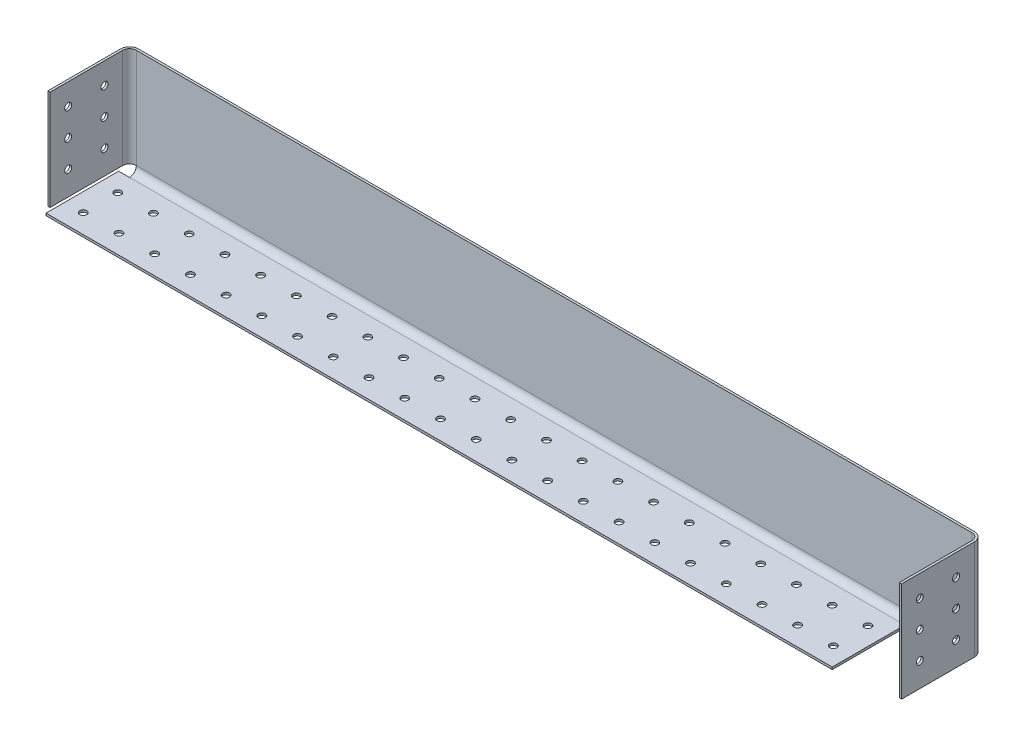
ISO-10303-21;
HEADER;
FILE_DESCRIPTION(('STEP AP214'),'2;1');
FILE_NAME('part.step','',(''),(''),'','','');
FILE_SCHEMA(('AUTOMOTIVE_DESIGN { 1 0 10303 214 1 1 1 1 }'));
ENDSEC;
DATA;
#1=APPLICATION_CONTEXT('core data for automotive mechanical design processes');
#2=APPLICATION_PROTOCOL_DEFINITION('international standard','automotive_design',2000,#1);
#3=PRODUCT_CONTEXT('',#1,'mechanical');
#4=PRODUCT('Part','Part','',(#3));
#5=PRODUCT_RELATED_PRODUCT_CATEGORY('part','',(#4));
#6=PRODUCT_DEFINITION_FORMATION('','',#4);
#7=PRODUCT_DEFINITION_CONTEXT('part definition',#1,'design');
#8=PRODUCT_DEFINITION('design','',#6,#7);
#9=PRODUCT_DEFINITION_SHAPE('','',#8);
#10=(LENGTH_UNIT() NAMED_UNIT(*) SI_UNIT(.MILLI.,.METRE.));
#11=(NAMED_UNIT(*) PLANE_ANGLE_UNIT() SI_UNIT($,.RADIAN.));
#12=(NAMED_UNIT(*) SI_UNIT($,.STERADIAN.) SOLID_ANGLE_UNIT());
#13=UNCERTAINTY_MEASURE_WITH_UNIT(LENGTH_MEASURE(1.E-05),#10,'distance_accuracy_value','');
#14=(GEOMETRIC_REPRESENTATION_CONTEXT(3) GLOBAL_UNCERTAINTY_ASSIGNED_CONTEXT((#13)) GLOBAL_UNIT_ASSIGNED_CONTEXT((#10,
#11,#12)) REPRESENTATION_CONTEXT('',''));
#15=CARTESIAN_POINT('',(0.,0.,0.));
#16=DIRECTION('',(0.,0.,1.));
#17=DIRECTION('',(1.,0.,0.));
#18=AXIS2_PLACEMENT_3D('',#15,#16,#17);
#19=CARTESIAN_POINT('',(-534.6573,12.7,-50.8));
#20=DIRECTION('',(1.,0.,0.));
#21=DIRECTION('',(0.,0.,-1.));
#22=AXIS2_PLACEMENT_3D('',#19,#20,#21);
#23=PLANE('',#22);
#24=DIRECTION('',(0.,-1.,0.));
#25=VECTOR('',#24,1.);
#26=CARTESIAN_POINT('',(-534.6573,3.175,-50.8));
#27=LINE('',#26,#25);
#28=CARTESIAN_POINT('',(-534.6573,3.175,-50.8));
#29=VERTEX_POINT('',#28);
#30=CARTESIAN_POINT('',(-534.6573,0.,-50.8));
#31=VERTEX_POINT('',#30);
#32=EDGE_CURVE('E185',#29,#31,#27,.T.);
#33=ORIENTED_EDGE('',*,*,#32,.F.);
#34=CARTESIAN_POINT('',(-534.6573,12.7,-50.8));
#35=DIRECTION('',(-1.,0.,0.));
#36=DIRECTION('',(0.,0.,-1.));
#37=AXIS2_PLACEMENT_3D('',#34,#35,#36);
#38=CIRCLE('',#37,9.525);
#39=CARTESIAN_POINT('',(-534.6573,12.7,-60.325));
#40=VERTEX_POINT('',#39);
#41=EDGE_CURVE('E277',#40,#29,#38,.T.);
#42=ORIENTED_EDGE('',*,*,#41,.F.);
#43=DIRECTION('',(0.,0.,-1.));
#44=VECTOR('',#43,1.);
#45=CARTESIAN_POINT('',(-534.6573,12.7,-50.8));
#46=LINE('',#45,#44);
#47=CARTESIAN_POINT('',(-534.6573,12.7,-63.5));
#48=VERTEX_POINT('',#47);
#49=EDGE_CURVE('E40',#40,#48,#46,.T.);
#50=ORIENTED_EDGE('',*,*,#49,.T.);
#51=CARTESIAN_POINT('',(-534.6573,12.7,-50.8));
#52=DIRECTION('',(1.,0.,0.));
#53=DIRECTION('',(0.,0.,-1.));
#54=AXIS2_PLACEMENT_3D('',#51,#52,#53);
#55=CIRCLE('',#54,12.7);
#56=EDGE_CURVE('E269',#31,#48,#55,.T.);
#57=ORIENTED_EDGE('',*,*,#56,.F.);
#58=EDGE_LOOP('',(#33,#42,#50,#57));
#59=FACE_BOUND('',#58,.T.);
#60=ADVANCED_FACE('F32',(#59),#23,.F.);
#61=CARTESIAN_POINT('',(633.7427,0.,50.8));
#62=DIRECTION('',(0.,0.,-1.));
#63=DIRECTION('',(-1.,0.,0.));
#64=AXIS2_PLACEMENT_3D('',#61,#62,#63);
#65=PLANE('',#64);
#66=DIRECTION('',(0.,-1.,0.));
#67=VECTOR('',#66,1.);
#68=CARTESIAN_POINT('',(549.43375,0.,50.8));
#69=LINE('',#68,#67);
#70=CARTESIAN_POINT('',(549.43375,3.175,50.8));
#71=VERTEX_POINT('',#70);
#72=CARTESIAN_POINT('',(549.43375,0.,50.8));
#73=VERTEX_POINT('',#72);
#74=EDGE_CURVE('E165',#71,#73,#69,.T.);
#75=ORIENTED_EDGE('',*,*,#74,.F.);
#76=DIRECTION('',(-1.,0.,0.));
#77=VECTOR('',#76,1.);
#78=CARTESIAN_POINT('',(633.7427,3.175,50.8));
#79=LINE('',#78,#77);
#80=CARTESIAN_POINT('',(-549.81336951,3.175,50.8));
#81=VERTEX_POINT('',#80);
#82=EDGE_CURVE('E159',#71,#81,#79,.T.);
#83=ORIENTED_EDGE('',*,*,#82,.T.);
#84=DIRECTION('',(0.,-1.,0.));
#85=VECTOR('',#84,1.);
#86=CARTESIAN_POINT('',(-549.81336951,3.175,50.8));
#87=LINE('',#86,#85);
#88=CARTESIAN_POINT('',(-549.81336951,0.,50.8));
#89=VERTEX_POINT('',#88);
#90=EDGE_CURVE('E163',#81,#89,#87,.T.);
#91=ORIENTED_EDGE('',*,*,#90,.T.);
#92=DIRECTION('',(-1.,0.,0.));
#93=VECTOR('',#92,1.);
#94=CARTESIAN_POINT('',(633.7427,0.,50.8));
#95=LINE('',#94,#93);
#96=EDGE_CURVE('E298',#73,#89,#95,.T.);
#97=ORIENTED_EDGE('',*,*,#96,.F.);
#98=EDGE_LOOP('',(#75,#83,#91,#97));
#99=FACE_BOUND('',#98,.T.);
#100=ADVANCED_FACE('F34',(#99),#65,.F.);
#101=CARTESIAN_POINT('',(633.7427,0.,50.8));
#102=DIRECTION('',(0.,1.,0.));
#103=DIRECTION('',(0.,0.,1.));
#104=AXIS2_PLACEMENT_3D('',#101,#102,#103);
#105=PLANE('',#104);
#106=CARTESIAN_POINT('',(-74.9161956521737,0.,24.13));
#107=DIRECTION('',(0.,1.,0.));
#108=DIRECTION('',(0.,0.,1.));
#109=AXIS2_PLACEMENT_3D('',#106,#107,#108);
#110=CIRCLE('',#109,4.90219999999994);
#111=CARTESIAN_POINT('',(-74.9161956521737,0.,29.0321999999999));
#112=VERTEX_POINT('',#111);
#113=EDGE_CURVE('E394',#112,#112,#110,.T.);
#114=ORIENTED_EDGE('',*,*,#113,.T.);
#115=EDGE_LOOP('',(#114));
#116=FACE_BOUND('',#115,.T.);
#117=CARTESIAN_POINT('',(-24.9720652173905,0.,-24.13));
#118=DIRECTION('',(0.,1.,0.));
#119=DIRECTION('',(0.,0.,1.));
#120=AXIS2_PLACEMENT_3D('',#117,#118,#119);
#121=CIRCLE('',#120,4.90219999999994);
#122=CARTESIAN_POINT('',(-24.9720652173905,0.,-19.2278000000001));
#123=VERTEX_POINT('',#122);
#124=EDGE_CURVE('E398',#123,#123,#121,.T.);
#125=ORIENTED_EDGE('',*,*,#124,.T.);
#126=EDGE_LOOP('',(#125));
#127=FACE_BOUND('',#126,.T.);
#128=CARTESIAN_POINT('',(-24.972065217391,0.,24.13));
#129=DIRECTION('',(0.,1.,0.));
#130=DIRECTION('',(0.,0.,1.));
#131=AXIS2_PLACEMENT_3D('',#128,#129,#130);
#132=CIRCLE('',#131,4.90219999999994);
#133=CARTESIAN_POINT('',(-24.972065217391,0.,29.0321999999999));
#134=VERTEX_POINT('',#133);
#135=EDGE_CURVE('E402',#134,#134,#132,.T.);
#136=ORIENTED_EDGE('',*,*,#135,.T.);
#137=EDGE_LOOP('',(#136));
#138=FACE_BOUND('',#137,.T.);
#139=CARTESIAN_POINT('',(24.9720652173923,0.,-24.13));
#140=DIRECTION('',(0.,1.,0.));
#141=DIRECTION('',(0.,0.,1.));
#142=AXIS2_PLACEMENT_3D('',#139,#140,#141);
#143=CIRCLE('',#142,4.90219999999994);
#144=CARTESIAN_POINT('',(24.9720652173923,0.,-19.2278000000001));
#145=VERTEX_POINT('',#144);
#146=EDGE_CURVE('E406',#145,#145,#143,.T.);
#147=ORIENTED_EDGE('',*,*,#146,.T.);
#148=EDGE_LOOP('',(#147));
#149=FACE_BOUND('',#148,.T.);
#150=CARTESIAN_POINT('',(-174.804456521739,0.,24.13));
#151=DIRECTION('',(0.,1.,0.));
#152=DIRECTION('',(0.,0.,1.));
#153=AXIS2_PLACEMENT_3D('',#150,#151,#152);
#154=CIRCLE('',#153,4.90219999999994);
#155=CARTESIAN_POINT('',(-174.804456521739,0.,29.0321999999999));
#156=VERTEX_POINT('',#155);
#157=EDGE_CURVE('E410',#156,#156,#154,.T.);
#158=ORIENTED_EDGE('',*,*,#157,.T.);
#159=EDGE_LOOP('',(#158));
#160=FACE_BOUND('',#159,.T.);
#161=CARTESIAN_POINT('',(-124.860326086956,0.,-24.13));
#162=DIRECTION('',(0.,1.,0.));
#163=DIRECTION('',(0.,0.,1.));
#164=AXIS2_PLACEMENT_3D('',#161,#162,#163);
#165=CIRCLE('',#164,4.90219999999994);
#166=CARTESIAN_POINT('',(-124.860326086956,0.,-19.2278000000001));
#167=VERTEX_POINT('',#166);
#168=EDGE_CURVE('E414',#167,#167,#165,.T.);
#169=ORIENTED_EDGE('',*,*,#168,.T.);
#170=EDGE_LOOP('',(#169));
#171=FACE_BOUND('',#170,.T.);
#172=CARTESIAN_POINT('',(-124.860326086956,0.,24.13));
#173=DIRECTION('',(0.,1.,0.));
#174=DIRECTION('',(0.,0.,1.));
#175=AXIS2_PLACEMENT_3D('',#172,#173,#174);
#176=CIRCLE('',#175,4.90219999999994);
#177=CARTESIAN_POINT('',(-124.860326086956,0.,29.0321999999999));
#178=VERTEX_POINT('',#177);
#179=EDGE_CURVE('E418',#178,#178,#176,.T.);
#180=ORIENTED_EDGE('',*,*,#179,.T.);
#181=EDGE_LOOP('',(#180));
#182=FACE_BOUND('',#181,.T.);
#183=CARTESIAN_POINT('',(-74.9161956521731,0.,-24.13));
#184=DIRECTION('',(0.,1.,0.));
#185=DIRECTION('',(0.,0.,1.));
#186=AXIS2_PLACEMENT_3D('',#183,#184,#185);
#187=CIRCLE('',#186,4.90219999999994);
#188=CARTESIAN_POINT('',(-74.9161956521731,0.,-19.2278000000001));
#189=VERTEX_POINT('',#188);
#190=EDGE_CURVE('E422',#189,#189,#187,.T.);
#191=ORIENTED_EDGE('',*,*,#190,.T.);
#192=EDGE_LOOP('',(#191));
#193=FACE_BOUND('',#192,.T.);
#194=CARTESIAN_POINT('',(124.860326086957,0.,24.13));
#195=DIRECTION('',(0.,1.,0.));
#196=DIRECTION('',(0.,0.,1.));
#197=AXIS2_PLACEMENT_3D('',#194,#195,#196);
#198=CIRCLE('',#197,4.90219999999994);
#199=CARTESIAN_POINT('',(124.860326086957,0.,29.0321999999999));
#200=VERTEX_POINT('',#199);
#201=EDGE_CURVE('E426',#200,#200,#198,.T.);
#202=ORIENTED_EDGE('',*,*,#201,.T.);
#203=EDGE_LOOP('',(#202));
#204=FACE_BOUND('',#203,.T.);
#205=CARTESIAN_POINT('',(174.80445652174,0.,-24.13));
#206=DIRECTION('',(0.,1.,0.));
#207=DIRECTION('',(0.,0.,1.));
#208=AXIS2_PLACEMENT_3D('',#205,#206,#207);
#209=CIRCLE('',#208,4.90219999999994);
#210=CARTESIAN_POINT('',(174.80445652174,0.,-19.2278000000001));
#211=VERTEX_POINT('',#210);
#212=EDGE_CURVE('E430',#211,#211,#209,.T.);
#213=ORIENTED_EDGE('',*,*,#212,.T.);
#214=EDGE_LOOP('',(#213));
#215=FACE_BOUND('',#214,.T.);
#216=CARTESIAN_POINT('',(174.804456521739,0.,24.13));
#217=DIRECTION('',(0.,1.,0.));
#218=DIRECTION('',(0.,0.,1.));
#219=AXIS2_PLACEMENT_3D('',#216,#217,#218);
#220=CIRCLE('',#219,4.90219999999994);
#221=CARTESIAN_POINT('',(174.804456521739,0.,29.0321999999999));
#222=VERTEX_POINT('',#221);
#223=EDGE_CURVE('E434',#222,#222,#220,.T.);
#224=ORIENTED_EDGE('',*,*,#223,.T.);
#225=EDGE_LOOP('',(#224));
#226=FACE_BOUND('',#225,.T.);
#227=CARTESIAN_POINT('',(224.748586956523,0.,-24.13));
#228=DIRECTION('',(0.,1.,0.));
#229=DIRECTION('',(0.,0.,1.));
#230=AXIS2_PLACEMENT_3D('',#227,#228,#229);
#231=CIRCLE('',#230,4.90219999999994);
#232=CARTESIAN_POINT('',(224.748586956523,0.,-19.2278000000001));
#233=VERTEX_POINT('',#232);
#234=EDGE_CURVE('E438',#233,#233,#231,.T.);
#235=ORIENTED_EDGE('',*,*,#234,.T.);
#236=EDGE_LOOP('',(#235));
#237=FACE_BOUND('',#236,.T.);
#238=CARTESIAN_POINT('',(24.9720652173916,0.,24.13));
#239=DIRECTION('',(0.,1.,0.));
#240=DIRECTION('',(0.,0.,1.));
#241=AXIS2_PLACEMENT_3D('',#238,#239,#240);
#242=CIRCLE('',#241,4.90219999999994);
#243=CARTESIAN_POINT('',(24.9720652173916,0.,29.0321999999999));
#244=VERTEX_POINT('',#243);
#245=EDGE_CURVE('E442',#244,#244,#242,.T.);
#246=ORIENTED_EDGE('',*,*,#245,.T.);
#247=EDGE_LOOP('',(#246));
#248=FACE_BOUND('',#247,.T.);
#249=CARTESIAN_POINT('',(74.916195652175,0.,-24.13));
#250=DIRECTION('',(0.,1.,0.));
#251=DIRECTION('',(0.,0.,1.));
#252=AXIS2_PLACEMENT_3D('',#249,#250,#251);
#253=CIRCLE('',#252,4.90219999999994);
#254=CARTESIAN_POINT('',(74.916195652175,0.,-19.2278000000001));
#255=VERTEX_POINT('',#254);
#256=EDGE_CURVE('E446',#255,#255,#253,.T.);
#257=ORIENTED_EDGE('',*,*,#256,.T.);
#258=EDGE_LOOP('',(#257));
#259=FACE_BOUND('',#258,.T.);
#260=CARTESIAN_POINT('',(74.9161956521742,0.,24.13));
#261=DIRECTION('',(0.,1.,0.));
#262=DIRECTION('',(0.,0.,1.));
#263=AXIS2_PLACEMENT_3D('',#260,#261,#262);
#264=CIRCLE('',#263,4.90219999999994);
#265=CARTESIAN_POINT('',(74.9161956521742,0.,29.0321999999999));
#266=VERTEX_POINT('',#265);
#267=EDGE_CURVE('E450',#266,#266,#264,.T.);
#268=ORIENTED_EDGE('',*,*,#267,.T.);
#269=EDGE_LOOP('',(#268));
#270=FACE_BOUND('',#269,.T.);
#271=CARTESIAN_POINT('',(124.860326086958,0.,-24.13));
#272=DIRECTION('',(0.,1.,0.));
#273=DIRECTION('',(0.,0.,1.));
#274=AXIS2_PLACEMENT_3D('',#271,#272,#273);
#275=CIRCLE('',#274,4.90219999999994);
#276=CARTESIAN_POINT('',(124.860326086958,0.,-19.2278000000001));
#277=VERTEX_POINT('',#276);
#278=EDGE_CURVE('E454',#277,#277,#275,.T.);
#279=ORIENTED_EDGE('',*,*,#278,.T.);
#280=EDGE_LOOP('',(#279));
#281=FACE_BOUND('',#280,.T.);
#282=CARTESIAN_POINT('',(-474.469239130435,0.,24.13));
#283=DIRECTION('',(0.,1.,0.));
#284=DIRECTION('',(0.,0.,1.));
#285=AXIS2_PLACEMENT_3D('',#282,#283,#284);
#286=CIRCLE('',#285,4.90219999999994);
#287=CARTESIAN_POINT('',(-474.469239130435,0.,29.0321999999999));
#288=VERTEX_POINT('',#287);
#289=EDGE_CURVE('E458',#288,#288,#286,.T.);
#290=ORIENTED_EDGE('',*,*,#289,.T.);
#291=EDGE_LOOP('',(#290));
#292=FACE_BOUND('',#291,.T.);
#293=CARTESIAN_POINT('',(-424.525108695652,0.,-24.13));
#294=DIRECTION('',(0.,1.,0.));
#295=DIRECTION('',(0.,0.,1.));
#296=AXIS2_PLACEMENT_3D('',#293,#294,#295);
#297=CIRCLE('',#296,4.90219999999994);
#298=CARTESIAN_POINT('',(-424.525108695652,0.,-19.2278000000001));
#299=VERTEX_POINT('',#298);
#300=EDGE_CURVE('E462',#299,#299,#297,.T.);
#301=ORIENTED_EDGE('',*,*,#300,.T.);
#302=EDGE_LOOP('',(#301));
#303=FACE_BOUND('',#302,.T.);
#304=CARTESIAN_POINT('',(-424.525108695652,0.,24.13));
#305=DIRECTION('',(0.,1.,0.));
#306=DIRECTION('',(0.,0.,1.));
#307=AXIS2_PLACEMENT_3D('',#304,#305,#306);
#308=CIRCLE('',#307,4.90219999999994);
#309=CARTESIAN_POINT('',(-424.525108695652,0.,29.0321999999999));
#310=VERTEX_POINT('',#309);
#311=EDGE_CURVE('E466',#310,#310,#308,.T.);
#312=ORIENTED_EDGE('',*,*,#311,.T.);
#313=EDGE_LOOP('',(#312));
#314=FACE_BOUND('',#313,.T.);
#315=CARTESIAN_POINT('',(-374.580978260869,0.,-24.13));
#316=DIRECTION('',(0.,1.,0.));
#317=DIRECTION('',(0.,0.,1.));
#318=AXIS2_PLACEMENT_3D('',#315,#316,#317);
#319=CIRCLE('',#318,4.90219999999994);
#320=CARTESIAN_POINT('',(-374.580978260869,0.,-19.2278000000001));
#321=VERTEX_POINT('',#320);
#322=EDGE_CURVE('E470',#321,#321,#319,.T.);
#323=ORIENTED_EDGE('',*,*,#322,.T.);
#324=EDGE_LOOP('',(#323));
#325=FACE_BOUND('',#324,.T.);
#326=CARTESIAN_POINT('',(-524.413369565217,0.,-24.13));
#327=DIRECTION('',(0.,1.,0.));
#328=DIRECTION('',(0.,0.,1.));
#329=AXIS2_PLACEMENT_3D('',#326,#327,#328);
#330=CIRCLE('',#329,4.90220000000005);
#331=CARTESIAN_POINT('',(-524.413369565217,0.,-19.2278));
#332=VERTEX_POINT('',#331);
#333=EDGE_CURVE('E474',#332,#332,#330,.T.);
#334=ORIENTED_EDGE('',*,*,#333,.T.);
#335=EDGE_LOOP('',(#334));
#336=FACE_BOUND('',#335,.T.);
#337=CARTESIAN_POINT('',(-524.413369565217,0.,24.13));
#338=DIRECTION('',(0.,1.,0.));
#339=DIRECTION('',(0.,0.,1.));
#340=AXIS2_PLACEMENT_3D('',#337,#338,#339);
#341=CIRCLE('',#340,4.90220000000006);
#342=CARTESIAN_POINT('',(-524.413369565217,0.,29.0322000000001));
#343=VERTEX_POINT('',#342);
#344=EDGE_CURVE('E478',#343,#343,#341,.T.);
#345=ORIENTED_EDGE('',*,*,#344,.T.);
#346=EDGE_LOOP('',(#345));
#347=FACE_BOUND('',#346,.T.);
#348=CARTESIAN_POINT('',(-474.469239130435,0.,-24.13));
#349=DIRECTION('',(0.,1.,0.));
#350=DIRECTION('',(0.,0.,1.));
#351=AXIS2_PLACEMENT_3D('',#348,#349,#350);
#352=CIRCLE('',#351,4.90219999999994);
#353=CARTESIAN_POINT('',(-474.469239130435,0.,-19.2278000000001));
#354=VERTEX_POINT('',#353);
#355=EDGE_CURVE('E482',#354,#354,#352,.T.);
#356=ORIENTED_EDGE('',*,*,#355,.T.);
#357=EDGE_LOOP('',(#356));
#358=FACE_BOUND('',#357,.T.);
#359=CARTESIAN_POINT('',(-274.692717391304,0.,24.13));
#360=DIRECTION('',(0.,1.,0.));
#361=DIRECTION('',(0.,0.,1.));
#362=AXIS2_PLACEMENT_3D('',#359,#360,#361);
#363=CIRCLE('',#362,4.90219999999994);
#364=CARTESIAN_POINT('',(-274.692717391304,0.,29.0321999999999));
#365=VERTEX_POINT('',#364);
#366=EDGE_CURVE('E486',#365,#365,#363,.T.);
#367=ORIENTED_EDGE('',*,*,#366,.T.);
#368=EDGE_LOOP('',(#367));
#369=FACE_BOUND('',#368,.T.);
#370=CARTESIAN_POINT('',(-224.748586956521,0.,-24.13));
#371=DIRECTION('',(0.,1.,0.));
#372=DIRECTION('',(0.,0.,1.));
#373=AXIS2_PLACEMENT_3D('',#370,#371,#372);
#374=CIRCLE('',#373,4.90219999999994);
#375=CARTESIAN_POINT('',(-224.748586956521,0.,-19.2278000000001));
#376=VERTEX_POINT('',#375);
#377=EDGE_CURVE('E490',#376,#376,#374,.T.);
#378=ORIENTED_EDGE('',*,*,#377,.T.);
#379=EDGE_LOOP('',(#378));
#380=FACE_BOUND('',#379,.T.);
#381=CARTESIAN_POINT('',(-224.748586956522,0.,24.13));
#382=DIRECTION('',(0.,1.,0.));
#383=DIRECTION('',(0.,0.,1.));
#384=AXIS2_PLACEMENT_3D('',#381,#382,#383);
#385=CIRCLE('',#384,4.90219999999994);
#386=CARTESIAN_POINT('',(-224.748586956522,0.,29.0321999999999));
#387=VERTEX_POINT('',#386);
#388=EDGE_CURVE('E494',#387,#387,#385,.T.);
#389=ORIENTED_EDGE('',*,*,#388,.T.);
#390=EDGE_LOOP('',(#389));
#391=FACE_BOUND('',#390,.T.);
#392=CARTESIAN_POINT('',(-174.804456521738,0.,-24.13));
#393=DIRECTION('',(0.,1.,0.));
#394=DIRECTION('',(0.,0.,1.));
#395=AXIS2_PLACEMENT_3D('',#392,#393,#394);
#396=CIRCLE('',#395,4.90219999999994);
#397=CARTESIAN_POINT('',(-174.804456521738,0.,-19.2278000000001));
#398=VERTEX_POINT('',#397);
#399=EDGE_CURVE('E498',#398,#398,#396,.T.);
#400=ORIENTED_EDGE('',*,*,#399,.T.);
#401=EDGE_LOOP('',(#400));
#402=FACE_BOUND('',#401,.T.);
#403=CARTESIAN_POINT('',(-374.580978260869,0.,24.13));
#404=DIRECTION('',(0.,1.,0.));
#405=DIRECTION('',(0.,0.,1.));
#406=AXIS2_PLACEMENT_3D('',#403,#404,#405);
#407=CIRCLE('',#406,4.90219999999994);
#408=CARTESIAN_POINT('',(-374.580978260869,0.,29.0321999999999));
#409=VERTEX_POINT('',#408);
#410=EDGE_CURVE('E502',#409,#409,#407,.T.);
#411=ORIENTED_EDGE('',*,*,#410,.T.);
#412=EDGE_LOOP('',(#411));
#413=FACE_BOUND('',#412,.T.);
#414=CARTESIAN_POINT('',(-324.636847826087,0.,-24.13));
#415=DIRECTION('',(0.,1.,0.));
#416=DIRECTION('',(0.,0.,1.));
#417=AXIS2_PLACEMENT_3D('',#414,#415,#416);
#418=CIRCLE('',#417,4.90219999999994);
#419=CARTESIAN_POINT('',(-324.636847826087,0.,-19.2278000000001));
#420=VERTEX_POINT('',#419);
#421=EDGE_CURVE('E506',#420,#420,#418,.T.);
#422=ORIENTED_EDGE('',*,*,#421,.T.);
#423=EDGE_LOOP('',(#422));
#424=FACE_BOUND('',#423,.T.);
#425=CARTESIAN_POINT('',(-324.636847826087,0.,24.13));
#426=DIRECTION('',(0.,1.,0.));
#427=DIRECTION('',(0.,0.,1.));
#428=AXIS2_PLACEMENT_3D('',#425,#426,#427);
#429=CIRCLE('',#428,4.90219999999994);
#430=CARTESIAN_POINT('',(-324.636847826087,0.,29.0321999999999));
#431=VERTEX_POINT('',#430);
#432=EDGE_CURVE('E510',#431,#431,#429,.T.);
#433=ORIENTED_EDGE('',*,*,#432,.T.);
#434=EDGE_LOOP('',(#433));
#435=FACE_BOUND('',#434,.T.);
#436=CARTESIAN_POINT('',(-274.692717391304,0.,-24.13));
#437=DIRECTION('',(0.,1.,0.));
#438=DIRECTION('',(0.,0.,1.));
#439=AXIS2_PLACEMENT_3D('',#436,#437,#438);
#440=CIRCLE('',#439,4.90219999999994);
#441=CARTESIAN_POINT('',(-274.692717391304,0.,-19.2278000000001));
#442=VERTEX_POINT('',#441);
#443=EDGE_CURVE('E514',#442,#442,#440,.T.);
#444=ORIENTED_EDGE('',*,*,#443,.T.);
#445=EDGE_LOOP('',(#444));
#446=FACE_BOUND('',#445,.T.);
#447=CARTESIAN_POINT('',(524.413369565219,0.,-24.13));
#448=DIRECTION('',(0.,1.,0.));
#449=DIRECTION('',(0.,0.,1.));
#450=AXIS2_PLACEMENT_3D('',#447,#448,#449);
#451=CIRCLE('',#450,4.90219999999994);
#452=CARTESIAN_POINT('',(524.413369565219,0.,-19.2278000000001));
#453=VERTEX_POINT('',#452);
#454=EDGE_CURVE('E518',#453,#453,#451,.T.);
#455=ORIENTED_EDGE('',*,*,#454,.T.);
#456=EDGE_LOOP('',(#455));
#457=FACE_BOUND('',#456,.T.);
#458=CARTESIAN_POINT('',(474.469239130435,0.,24.13));
#459=DIRECTION('',(0.,1.,0.));
#460=DIRECTION('',(0.,0.,1.));
#461=AXIS2_PLACEMENT_3D('',#458,#459,#460);
#462=CIRCLE('',#461,4.90219999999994);
#463=CARTESIAN_POINT('',(474.469239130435,0.,29.0321999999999));
#464=VERTEX_POINT('',#463);
#465=EDGE_CURVE('E522',#464,#464,#462,.T.);
#466=ORIENTED_EDGE('',*,*,#465,.T.);
#467=EDGE_LOOP('',(#466));
#468=FACE_BOUND('',#467,.T.);
#469=CARTESIAN_POINT('',(474.469239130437,0.,-24.13));
#470=DIRECTION('',(0.,1.,0.));
#471=DIRECTION('',(0.,0.,1.));
#472=AXIS2_PLACEMENT_3D('',#469,#470,#471);
#473=CIRCLE('',#472,4.90219999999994);
#474=CARTESIAN_POINT('',(474.469239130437,0.,-19.2278000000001));
#475=VERTEX_POINT('',#474);
#476=EDGE_CURVE('E526',#475,#475,#473,.T.);
#477=ORIENTED_EDGE('',*,*,#476,.T.);
#478=EDGE_LOOP('',(#477));
#479=FACE_BOUND('',#478,.T.);
#480=CARTESIAN_POINT('',(424.525108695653,0.,24.13));
#481=DIRECTION('',(0.,1.,0.));
#482=DIRECTION('',(0.,0.,1.));
#483=AXIS2_PLACEMENT_3D('',#480,#481,#482);
#484=CIRCLE('',#483,4.90219999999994);
#485=CARTESIAN_POINT('',(424.525108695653,0.,29.0321999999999));
#486=VERTEX_POINT('',#485);
#487=EDGE_CURVE('E530',#486,#486,#484,.T.);
#488=ORIENTED_EDGE('',*,*,#487,.T.);
#489=EDGE_LOOP('',(#488));
#490=FACE_BOUND('',#489,.T.);
#491=CARTESIAN_POINT('',(524.413369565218,0.,24.13));
#492=DIRECTION('',(0.,1.,0.));
#493=DIRECTION('',(0.,0.,1.));
#494=AXIS2_PLACEMENT_3D('',#491,#492,#493);
#495=CIRCLE('',#494,4.90219999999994);
#496=CARTESIAN_POINT('',(524.413369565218,0.,29.0321999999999));
#497=VERTEX_POINT('',#496);
#498=EDGE_CURVE('E534',#497,#497,#495,.T.);
#499=ORIENTED_EDGE('',*,*,#498,.T.);
#500=EDGE_LOOP('',(#499));
#501=FACE_BOUND('',#500,.T.);
#502=CARTESIAN_POINT('',(324.636847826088,0.,-24.13));
#503=DIRECTION('',(0.,1.,0.));
#504=DIRECTION('',(0.,0.,1.));
#505=AXIS2_PLACEMENT_3D('',#502,#503,#504);
#506=CIRCLE('',#505,4.90219999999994);
#507=CARTESIAN_POINT('',(324.636847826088,0.,-19.2278000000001));
#508=VERTEX_POINT('',#507);
#509=EDGE_CURVE('E538',#508,#508,#506,.T.);
#510=ORIENTED_EDGE('',*,*,#509,.T.);
#511=EDGE_LOOP('',(#510));
#512=FACE_BOUND('',#511,.T.);
#513=CARTESIAN_POINT('',(274.692717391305,0.,24.13));
#514=DIRECTION('',(0.,1.,0.));
#515=DIRECTION('',(0.,0.,1.));
#516=AXIS2_PLACEMENT_3D('',#513,#514,#515);
#517=CIRCLE('',#516,4.90219999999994);
#518=CARTESIAN_POINT('',(274.692717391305,0.,29.0321999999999));
#519=VERTEX_POINT('',#518);
#520=EDGE_CURVE('E542',#519,#519,#517,.T.);
#521=ORIENTED_EDGE('',*,*,#520,.T.);
#522=EDGE_LOOP('',(#521));
#523=FACE_BOUND('',#522,.T.);
#524=CARTESIAN_POINT('',(274.692717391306,0.,-24.13));
#525=DIRECTION('',(0.,1.,0.));
#526=DIRECTION('',(0.,0.,1.));
#527=AXIS2_PLACEMENT_3D('',#524,#525,#526);
#528=CIRCLE('',#527,4.90219999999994);
#529=CARTESIAN_POINT('',(274.692717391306,0.,-19.2278000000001));
#530=VERTEX_POINT('',#529);
#531=EDGE_CURVE('E546',#530,#530,#528,.T.);
#532=ORIENTED_EDGE('',*,*,#531,.T.);
#533=EDGE_LOOP('',(#532));
#534=FACE_BOUND('',#533,.T.);
#535=CARTESIAN_POINT('',(224.748586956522,0.,24.13));
#536=DIRECTION('',(0.,1.,0.));
#537=DIRECTION('',(0.,0.,1.));
#538=AXIS2_PLACEMENT_3D('',#535,#536,#537);
#539=CIRCLE('',#538,4.90219999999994);
#540=CARTESIAN_POINT('',(224.748586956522,0.,29.0321999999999));
#541=VERTEX_POINT('',#540);
#542=EDGE_CURVE('E550',#541,#541,#539,.T.);
#543=ORIENTED_EDGE('',*,*,#542,.T.);
#544=EDGE_LOOP('',(#543));
#545=FACE_BOUND('',#544,.T.);
#546=CARTESIAN_POINT('',(424.525108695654,0.,-24.13));
#547=DIRECTION('',(0.,1.,0.));
#548=DIRECTION('',(0.,0.,1.));
#549=AXIS2_PLACEMENT_3D('',#546,#547,#548);
#550=CIRCLE('',#549,4.90219999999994);
#551=CARTESIAN_POINT('',(424.525108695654,0.,-19.2278000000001));
#552=VERTEX_POINT('',#551);
#553=EDGE_CURVE('E554',#552,#552,#550,.T.);
#554=ORIENTED_EDGE('',*,*,#553,.T.);
#555=EDGE_LOOP('',(#554));
#556=FACE_BOUND('',#555,.T.);
#557=CARTESIAN_POINT('',(374.58097826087,0.,24.13));
#558=DIRECTION('',(0.,1.,0.));
#559=DIRECTION('',(0.,0.,1.));
#560=AXIS2_PLACEMENT_3D('',#557,#558,#559);
#561=CIRCLE('',#560,4.90219999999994);
#562=CARTESIAN_POINT('',(374.58097826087,0.,29.0321999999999));
#563=VERTEX_POINT('',#562);
#564=EDGE_CURVE('E558',#563,#563,#561,.T.);
#565=ORIENTED_EDGE('',*,*,#564,.T.);
#566=EDGE_LOOP('',(#565));
#567=FACE_BOUND('',#566,.T.);
#568=CARTESIAN_POINT('',(374.580978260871,0.,-24.13));
#569=DIRECTION('',(0.,1.,0.));
#570=DIRECTION('',(0.,0.,1.));
#571=AXIS2_PLACEMENT_3D('',#568,#569,#570);
#572=CIRCLE('',#571,4.90219999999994);
#573=CARTESIAN_POINT('',(374.580978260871,0.,-19.2278000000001));
#574=VERTEX_POINT('',#573);
#575=EDGE_CURVE('E562',#574,#574,#572,.T.);
#576=ORIENTED_EDGE('',*,*,#575,.T.);
#577=EDGE_LOOP('',(#576));
#578=FACE_BOUND('',#577,.T.);
#579=CARTESIAN_POINT('',(324.636847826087,0.,24.13));
#580=DIRECTION('',(0.,1.,0.));
#581=DIRECTION('',(0.,0.,1.));
#582=AXIS2_PLACEMENT_3D('',#579,#580,#581);
#583=CIRCLE('',#582,4.90219999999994);
#584=CARTESIAN_POINT('',(324.636847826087,0.,29.0321999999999));
#585=VERTEX_POINT('',#584);
#586=EDGE_CURVE('E565',#585,#585,#583,.T.);
#587=ORIENTED_EDGE('',*,*,#586,.T.);
#588=EDGE_LOOP('',(#587));
#589=FACE_BOUND('',#588,.T.);
#590=DIRECTION('',(0.,0.,1.));
#591=VECTOR('',#590,1.);
#592=CARTESIAN_POINT('',(549.43375,0.,-69.4733374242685));
#593=LINE('',#592,#591);
#594=CARTESIAN_POINT('',(549.43375,0.,-50.8));
#595=VERTEX_POINT('',#594);
#596=EDGE_CURVE('E184',#595,#73,#593,.T.);
#597=ORIENTED_EDGE('',*,*,#596,.T.);
#598=ORIENTED_EDGE('',*,*,#96,.T.);
#599=DIRECTION('',(0.,0.,1.));
#600=VECTOR('',#599,1.);
#601=CARTESIAN_POINT('',(-549.81336951,0.,-50.8));
#602=LINE('',#601,#600);
#603=CARTESIAN_POINT('',(-549.81336951,0.,-50.8));
#604=VERTEX_POINT('',#603);
#605=EDGE_CURVE('E183',#604,#89,#602,.T.);
#606=ORIENTED_EDGE('',*,*,#605,.F.);
#607=DIRECTION('',(-1.,0.,0.));
#608=VECTOR('',#607,1.);
#609=CARTESIAN_POINT('',(-549.81336951,0.,-50.8));
#610=LINE('',#609,#608);
#611=EDGE_CURVE('E179',#31,#604,#610,.T.);
#612=ORIENTED_EDGE('',*,*,#611,.F.);
#613=DIRECTION('',(-1.,0.,0.));
#614=VECTOR('',#613,1.);
#615=CARTESIAN_POINT('',(633.7427,0.,-50.8));
#616=LINE('',#615,#614);
#617=EDGE_CURVE('E295',#595,#31,#616,.T.);
#618=ORIENTED_EDGE('',*,*,#617,.F.);
#619=EDGE_LOOP('',(#597,#598,#606,#612,#618));
#620=FACE_BOUND('',#619,.T.);
#621=ADVANCED_FACE('F314',(#116,#127,#138,#149,#160,#171,#182,#193,#204,#215,#226,#237,#248,
#259,#270,#281,#292,#303,#314,#325,#336,#347,#358,#369,#380,#391,#402,#413,#424,#435,#446,#457,
#468,#479,#490,#501,#512,#523,#534,#545,#556,#567,#578,#589,#620),#105,.F.);
#622=CARTESIAN_POINT('',(633.7427,12.7,-50.8));
#623=DIRECTION('',(-1.,0.,0.));
#624=DIRECTION('',(0.,0.,1.));
#625=AXIS2_PLACEMENT_3D('',#622,#623,#624);
#626=CYLINDRICAL_SURFACE('',#625,12.7);
#627=CARTESIAN_POINT('',(549.43375,12.7,-50.8));
#628=DIRECTION('',(1.,0.,0.));
#629=DIRECTION('',(0.,0.,-1.));
#630=AXIS2_PLACEMENT_3D('',#627,#628,#629);
#631=CIRCLE('',#630,12.7);
#632=CARTESIAN_POINT('',(549.43375,12.7,-63.5));
#633=VERTEX_POINT('',#632);
#634=EDGE_CURVE('E200',#595,#633,#631,.T.);
#635=ORIENTED_EDGE('',*,*,#634,.F.);
#636=ORIENTED_EDGE('',*,*,#617,.T.);
#637=ORIENTED_EDGE('',*,*,#56,.T.);
#638=DIRECTION('',(-1.,0.,0.));
#639=VECTOR('',#638,1.);
#640=CARTESIAN_POINT('',(633.7427,12.7,-63.5));
#641=LINE('',#640,#639);
#642=EDGE_CURVE('E291',#633,#48,#641,.T.);
#643=ORIENTED_EDGE('',*,*,#642,.F.);
#644=EDGE_LOOP('',(#635,#636,#637,#643));
#645=FACE_BOUND('',#644,.T.);
#646=ADVANCED_FACE('F311',(#645),#626,.T.);
#647=CARTESIAN_POINT('',(633.7427,12.7,-50.8));
#648=DIRECTION('',(-1.,0.,0.));
#649=DIRECTION('',(0.,0.,1.));
#650=AXIS2_PLACEMENT_3D('',#647,#648,#649);
#651=CYLINDRICAL_SURFACE('',#650,9.525);
#652=CARTESIAN_POINT('',(549.43375,12.7,-50.8));
#653=DIRECTION('',(1.,0.,0.));
#654=DIRECTION('',(0.,0.,-1.));
#655=AXIS2_PLACEMENT_3D('',#652,#653,#654);
#656=CIRCLE('',#655,9.525);
#657=CARTESIAN_POINT('',(549.43375,12.7,-60.325));
#658=VERTEX_POINT('',#657);
#659=CARTESIAN_POINT('',(549.43375,3.175,-50.8));
#660=VERTEX_POINT('',#659);
#661=EDGE_CURVE('E196',#658,#660,#656,.F.);
#662=ORIENTED_EDGE('',*,*,#661,.F.);
#663=DIRECTION('',(-1.,0.,0.));
#664=VECTOR('',#663,1.);
#665=CARTESIAN_POINT('',(633.7427,12.7,-60.325));
#666=LINE('',#665,#664);
#667=EDGE_CURVE('E286',#658,#40,#666,.T.);
#668=ORIENTED_EDGE('',*,*,#667,.T.);
#669=ORIENTED_EDGE('',*,*,#41,.T.);
#670=DIRECTION('',(-1.,0.,0.));
#671=VECTOR('',#670,1.);
#672=CARTESIAN_POINT('',(633.7427,3.175,-50.8));
#673=LINE('',#672,#671);
#674=EDGE_CURVE('E168',#660,#29,#673,.T.);
#675=ORIENTED_EDGE('',*,*,#674,.F.);
#676=EDGE_LOOP('',(#662,#668,#669,#675));
#677=FACE_BOUND('',#676,.T.);
#678=ADVANCED_FACE('F321',(#677),#651,.F.);
#679=CARTESIAN_POINT('',(633.7427,3.175,50.8));
#680=DIRECTION('',(0.,-1.,0.));
#681=DIRECTION('',(0.,0.,-1.));
#682=AXIS2_PLACEMENT_3D('',#679,#680,#681);
#683=PLANE('',#682);
#684=CARTESIAN_POINT('',(-74.9161956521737,3.175,24.13));
#685=DIRECTION('',(0.,1.,0.));
#686=DIRECTION('',(0.,0.,1.));
#687=AXIS2_PLACEMENT_3D('',#684,#685,#686);
#688=CIRCLE('',#687,4.90219999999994);
#689=CARTESIAN_POINT('',(-74.9161956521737,3.175,29.0321999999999));
#690=VERTEX_POINT('',#689);
#691=EDGE_CURVE('E634',#690,#690,#688,.T.);
#692=ORIENTED_EDGE('',*,*,#691,.F.);
#693=EDGE_LOOP('',(#692));
#694=FACE_BOUND('',#693,.T.);
#695=CARTESIAN_POINT('',(-24.9720652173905,3.175,-24.13));
#696=DIRECTION('',(0.,1.,0.));
#697=DIRECTION('',(0.,0.,1.));
#698=AXIS2_PLACEMENT_3D('',#695,#696,#697);
#699=CIRCLE('',#698,4.90219999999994);
#700=CARTESIAN_POINT('',(-24.9720652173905,3.175,-19.2278000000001));
#701=VERTEX_POINT('',#700);
#702=EDGE_CURVE('E638',#701,#701,#699,.T.);
#703=ORIENTED_EDGE('',*,*,#702,.F.);
#704=EDGE_LOOP('',(#703));
#705=FACE_BOUND('',#704,.T.);
#706=CARTESIAN_POINT('',(-24.972065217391,3.175,24.13));
#707=DIRECTION('',(0.,1.,0.));
#708=DIRECTION('',(0.,0.,1.));
#709=AXIS2_PLACEMENT_3D('',#706,#707,#708);
#710=CIRCLE('',#709,4.90219999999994);
#711=CARTESIAN_POINT('',(-24.972065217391,3.175,29.0321999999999));
#712=VERTEX_POINT('',#711);
#713=EDGE_CURVE('E626',#712,#712,#710,.T.);
#714=ORIENTED_EDGE('',*,*,#713,.F.);
#715=EDGE_LOOP('',(#714));
#716=FACE_BOUND('',#715,.T.);
#717=CARTESIAN_POINT('',(24.9720652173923,3.175,-24.13));
#718=DIRECTION('',(0.,1.,0.));
#719=DIRECTION('',(0.,0.,1.));
#720=AXIS2_PLACEMENT_3D('',#717,#718,#719);
#721=CIRCLE('',#720,4.90219999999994);
#722=CARTESIAN_POINT('',(24.9720652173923,3.175,-19.2278000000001));
#723=VERTEX_POINT('',#722);
#724=EDGE_CURVE('E630',#723,#723,#721,.T.);
#725=ORIENTED_EDGE('',*,*,#724,.F.);
#726=EDGE_LOOP('',(#725));
#727=FACE_BOUND('',#726,.T.);
#728=CARTESIAN_POINT('',(-174.804456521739,3.175,24.13));
#729=DIRECTION('',(0.,1.,0.));
#730=DIRECTION('',(0.,0.,1.));
#731=AXIS2_PLACEMENT_3D('',#728,#729,#730);
#732=CIRCLE('',#731,4.90219999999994);
#733=CARTESIAN_POINT('',(-174.804456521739,3.175,29.0321999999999));
#734=VERTEX_POINT('',#733);
#735=EDGE_CURVE('E650',#734,#734,#732,.T.);
#736=ORIENTED_EDGE('',*,*,#735,.F.);
#737=EDGE_LOOP('',(#736));
#738=FACE_BOUND('',#737,.T.);
#739=CARTESIAN_POINT('',(-124.860326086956,3.175,-24.13));
#740=DIRECTION('',(0.,1.,0.));
#741=DIRECTION('',(0.,0.,1.));
#742=AXIS2_PLACEMENT_3D('',#739,#740,#741);
#743=CIRCLE('',#742,4.90219999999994);
#744=CARTESIAN_POINT('',(-124.860326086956,3.175,-19.2278000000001));
#745=VERTEX_POINT('',#744);
#746=EDGE_CURVE('E654',#745,#745,#743,.T.);
#747=ORIENTED_EDGE('',*,*,#746,.F.);
#748=EDGE_LOOP('',(#747));
#749=FACE_BOUND('',#748,.T.);
#750=CARTESIAN_POINT('',(-124.860326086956,3.175,24.13));
#751=DIRECTION('',(0.,1.,0.));
#752=DIRECTION('',(0.,0.,1.));
#753=AXIS2_PLACEMENT_3D('',#750,#751,#752);
#754=CIRCLE('',#753,4.90219999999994);
#755=CARTESIAN_POINT('',(-124.860326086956,3.175,29.0321999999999));
#756=VERTEX_POINT('',#755);
#757=EDGE_CURVE('E642',#756,#756,#754,.T.);
#758=ORIENTED_EDGE('',*,*,#757,.F.);
#759=EDGE_LOOP('',(#758));
#760=FACE_BOUND('',#759,.T.);
#761=CARTESIAN_POINT('',(-74.9161956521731,3.175,-24.13));
#762=DIRECTION('',(0.,1.,0.));
#763=DIRECTION('',(0.,0.,1.));
#764=AXIS2_PLACEMENT_3D('',#761,#762,#763);
#765=CIRCLE('',#764,4.90219999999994);
#766=CARTESIAN_POINT('',(-74.9161956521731,3.175,-19.2278000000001));
#767=VERTEX_POINT('',#766);
#768=EDGE_CURVE('E646',#767,#767,#765,.T.);
#769=ORIENTED_EDGE('',*,*,#768,.F.);
#770=EDGE_LOOP('',(#769));
#771=FACE_BOUND('',#770,.T.);
#772=CARTESIAN_POINT('',(124.860326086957,3.175,24.13));
#773=DIRECTION('',(0.,1.,0.));
#774=DIRECTION('',(0.,0.,1.));
#775=AXIS2_PLACEMENT_3D('',#772,#773,#774);
#776=CIRCLE('',#775,4.90219999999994);
#777=CARTESIAN_POINT('',(124.860326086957,3.175,29.0321999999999));
#778=VERTEX_POINT('',#777);
#779=EDGE_CURVE('E602',#778,#778,#776,.T.);
#780=ORIENTED_EDGE('',*,*,#779,.F.);
#781=EDGE_LOOP('',(#780));
#782=FACE_BOUND('',#781,.T.);
#783=CARTESIAN_POINT('',(174.80445652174,3.175,-24.13));
#784=DIRECTION('',(0.,1.,0.));
#785=DIRECTION('',(0.,0.,1.));
#786=AXIS2_PLACEMENT_3D('',#783,#784,#785);
#787=CIRCLE('',#786,4.90219999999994);
#788=CARTESIAN_POINT('',(174.80445652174,3.175,-19.2278000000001));
#789=VERTEX_POINT('',#788);
#790=EDGE_CURVE('E606',#789,#789,#787,.T.);
#791=ORIENTED_EDGE('',*,*,#790,.F.);
#792=EDGE_LOOP('',(#791));
#793=FACE_BOUND('',#792,.T.);
#794=CARTESIAN_POINT('',(174.804456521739,3.175,24.13));
#795=DIRECTION('',(0.,1.,0.));
#796=DIRECTION('',(0.,0.,1.));
#797=AXIS2_PLACEMENT_3D('',#794,#795,#796);
#798=CIRCLE('',#797,4.90219999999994);
#799=CARTESIAN_POINT('',(174.804456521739,3.175,29.0321999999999));
#800=VERTEX_POINT('',#799);
#801=EDGE_CURVE('E594',#800,#800,#798,.T.);
#802=ORIENTED_EDGE('',*,*,#801,.F.);
#803=EDGE_LOOP('',(#802));
#804=FACE_BOUND('',#803,.T.);
#805=CARTESIAN_POINT('',(224.748586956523,3.175,-24.13));
#806=DIRECTION('',(0.,1.,0.));
#807=DIRECTION('',(0.,0.,1.));
#808=AXIS2_PLACEMENT_3D('',#805,#806,#807);
#809=CIRCLE('',#808,4.90219999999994);
#810=CARTESIAN_POINT('',(224.748586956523,3.175,-19.2278000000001));
#811=VERTEX_POINT('',#810);
#812=EDGE_CURVE('E598',#811,#811,#809,.T.);
#813=ORIENTED_EDGE('',*,*,#812,.F.);
#814=EDGE_LOOP('',(#813));
#815=FACE_BOUND('',#814,.T.);
#816=CARTESIAN_POINT('',(24.9720652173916,3.175,24.13));
#817=DIRECTION('',(0.,1.,0.));
#818=DIRECTION('',(0.,0.,1.));
#819=AXIS2_PLACEMENT_3D('',#816,#817,#818);
#820=CIRCLE('',#819,4.90219999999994);
#821=CARTESIAN_POINT('',(24.9720652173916,3.175,29.0321999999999));
#822=VERTEX_POINT('',#821);
#823=EDGE_CURVE('E618',#822,#822,#820,.T.);
#824=ORIENTED_EDGE('',*,*,#823,.F.);
#825=EDGE_LOOP('',(#824));
#826=FACE_BOUND('',#825,.T.);
#827=CARTESIAN_POINT('',(74.916195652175,3.175,-24.13));
#828=DIRECTION('',(0.,1.,0.));
#829=DIRECTION('',(0.,0.,1.));
#830=AXIS2_PLACEMENT_3D('',#827,#828,#829);
#831=CIRCLE('',#830,4.90219999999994);
#832=CARTESIAN_POINT('',(74.916195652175,3.175,-19.2278000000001));
#833=VERTEX_POINT('',#832);
#834=EDGE_CURVE('E622',#833,#833,#831,.T.);
#835=ORIENTED_EDGE('',*,*,#834,.F.);
#836=EDGE_LOOP('',(#835));
#837=FACE_BOUND('',#836,.T.);
#838=CARTESIAN_POINT('',(74.9161956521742,3.175,24.13));
#839=DIRECTION('',(0.,1.,0.));
#840=DIRECTION('',(0.,0.,1.));
#841=AXIS2_PLACEMENT_3D('',#838,#839,#840);
#842=CIRCLE('',#841,4.90219999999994);
#843=CARTESIAN_POINT('',(74.9161956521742,3.175,29.0321999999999));
#844=VERTEX_POINT('',#843);
#845=EDGE_CURVE('E610',#844,#844,#842,.T.);
#846=ORIENTED_EDGE('',*,*,#845,.F.);
#847=EDGE_LOOP('',(#846));
#848=FACE_BOUND('',#847,.T.);
#849=CARTESIAN_POINT('',(124.860326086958,3.175,-24.13));
#850=DIRECTION('',(0.,1.,0.));
#851=DIRECTION('',(0.,0.,1.));
#852=AXIS2_PLACEMENT_3D('',#849,#850,#851);
#853=CIRCLE('',#852,4.90219999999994);
#854=CARTESIAN_POINT('',(124.860326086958,3.175,-19.2278000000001));
#855=VERTEX_POINT('',#854);
#856=EDGE_CURVE('E614',#855,#855,#853,.T.);
#857=ORIENTED_EDGE('',*,*,#856,.F.);
#858=EDGE_LOOP('',(#857));
#859=FACE_BOUND('',#858,.T.);
#860=CARTESIAN_POINT('',(-474.469239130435,3.175,24.13));
#861=DIRECTION('',(0.,1.,0.));
#862=DIRECTION('',(0.,0.,1.));
#863=AXIS2_PLACEMENT_3D('',#860,#861,#862);
#864=CIRCLE('',#863,4.90219999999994);
#865=CARTESIAN_POINT('',(-474.469239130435,3.175,29.0321999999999));
#866=VERTEX_POINT('',#865);
#867=EDGE_CURVE('E698',#866,#866,#864,.T.);
#868=ORIENTED_EDGE('',*,*,#867,.F.);
#869=EDGE_LOOP('',(#868));
#870=FACE_BOUND('',#869,.T.);
#871=CARTESIAN_POINT('',(-424.525108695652,3.175,-24.13));
#872=DIRECTION('',(0.,1.,0.));
#873=DIRECTION('',(0.,0.,1.));
#874=AXIS2_PLACEMENT_3D('',#871,#872,#873);
#875=CIRCLE('',#874,4.90219999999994);
#876=CARTESIAN_POINT('',(-424.525108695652,3.175,-19.2278000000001));
#877=VERTEX_POINT('',#876);
#878=EDGE_CURVE('E702',#877,#877,#875,.T.);
#879=ORIENTED_EDGE('',*,*,#878,.F.);
#880=EDGE_LOOP('',(#879));
#881=FACE_BOUND('',#880,.T.);
#882=CARTESIAN_POINT('',(-424.525108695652,3.175,24.13));
#883=DIRECTION('',(0.,1.,0.));
#884=DIRECTION('',(0.,0.,1.));
#885=AXIS2_PLACEMENT_3D('',#882,#883,#884);
#886=CIRCLE('',#885,4.90219999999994);
#887=CARTESIAN_POINT('',(-424.525108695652,3.175,29.0321999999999));
#888=VERTEX_POINT('',#887);
#889=EDGE_CURVE('E690',#888,#888,#886,.T.);
#890=ORIENTED_EDGE('',*,*,#889,.F.);
#891=EDGE_LOOP('',(#890));
#892=FACE_BOUND('',#891,.T.);
#893=CARTESIAN_POINT('',(-374.580978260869,3.175,-24.13));
#894=DIRECTION('',(0.,1.,0.));
#895=DIRECTION('',(0.,0.,1.));
#896=AXIS2_PLACEMENT_3D('',#893,#894,#895);
#897=CIRCLE('',#896,4.90219999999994);
#898=CARTESIAN_POINT('',(-374.580978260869,3.175,-19.2278000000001));
#899=VERTEX_POINT('',#898);
#900=EDGE_CURVE('E694',#899,#899,#897,.T.);
#901=ORIENTED_EDGE('',*,*,#900,.F.);
#902=EDGE_LOOP('',(#901));
#903=FACE_BOUND('',#902,.T.);
#904=CARTESIAN_POINT('',(-524.413369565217,3.175,-24.13));
#905=DIRECTION('',(0.,1.,0.));
#906=DIRECTION('',(0.,0.,1.));
#907=AXIS2_PLACEMENT_3D('',#904,#905,#906);
#908=CIRCLE('',#907,4.90220000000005);
#909=CARTESIAN_POINT('',(-524.413369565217,3.175,-19.2278));
#910=VERTEX_POINT('',#909);
#911=EDGE_CURVE('E714',#910,#910,#908,.T.);
#912=ORIENTED_EDGE('',*,*,#911,.F.);
#913=EDGE_LOOP('',(#912));
#914=FACE_BOUND('',#913,.T.);
#915=CARTESIAN_POINT('',(-524.413369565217,3.175,24.13));
#916=DIRECTION('',(0.,1.,0.));
#917=DIRECTION('',(0.,0.,1.));
#918=AXIS2_PLACEMENT_3D('',#915,#916,#917);
#919=CIRCLE('',#918,4.90220000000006);
#920=CARTESIAN_POINT('',(-524.413369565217,3.175,29.0322000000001));
#921=VERTEX_POINT('',#920);
#922=EDGE_CURVE('E706',#921,#921,#919,.T.);
#923=ORIENTED_EDGE('',*,*,#922,.F.);
#924=EDGE_LOOP('',(#923));
#925=FACE_BOUND('',#924,.T.);
#926=CARTESIAN_POINT('',(-474.469239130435,3.175,-24.13));
#927=DIRECTION('',(0.,1.,0.));
#928=DIRECTION('',(0.,0.,1.));
#929=AXIS2_PLACEMENT_3D('',#926,#927,#928);
#930=CIRCLE('',#929,4.90219999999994);
#931=CARTESIAN_POINT('',(-474.469239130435,3.175,-19.2278000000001));
#932=VERTEX_POINT('',#931);
#933=EDGE_CURVE('E710',#932,#932,#930,.T.);
#934=ORIENTED_EDGE('',*,*,#933,.F.);
#935=EDGE_LOOP('',(#934));
#936=FACE_BOUND('',#935,.T.);
#937=CARTESIAN_POINT('',(-274.692717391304,3.175,24.13));
#938=DIRECTION('',(0.,1.,0.));
#939=DIRECTION('',(0.,0.,1.));
#940=AXIS2_PLACEMENT_3D('',#937,#938,#939);
#941=CIRCLE('',#940,4.90219999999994);
#942=CARTESIAN_POINT('',(-274.692717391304,3.175,29.0321999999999));
#943=VERTEX_POINT('',#942);
#944=EDGE_CURVE('E666',#943,#943,#941,.T.);
#945=ORIENTED_EDGE('',*,*,#944,.F.);
#946=EDGE_LOOP('',(#945));
#947=FACE_BOUND('',#946,.T.);
#948=CARTESIAN_POINT('',(-224.748586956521,3.175,-24.13));
#949=DIRECTION('',(0.,1.,0.));
#950=DIRECTION('',(0.,0.,1.));
#951=AXIS2_PLACEMENT_3D('',#948,#949,#950);
#952=CIRCLE('',#951,4.90219999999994);
#953=CARTESIAN_POINT('',(-224.748586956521,3.175,-19.2278000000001));
#954=VERTEX_POINT('',#953);
#955=EDGE_CURVE('E670',#954,#954,#952,.T.);
#956=ORIENTED_EDGE('',*,*,#955,.F.);
#957=EDGE_LOOP('',(#956));
#958=FACE_BOUND('',#957,.T.);
#959=CARTESIAN_POINT('',(-224.748586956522,3.175,24.13));
#960=DIRECTION('',(0.,1.,0.));
#961=DIRECTION('',(0.,0.,1.));
#962=AXIS2_PLACEMENT_3D('',#959,#960,#961);
#963=CIRCLE('',#962,4.90219999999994);
#964=CARTESIAN_POINT('',(-224.748586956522,3.175,29.0321999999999));
#965=VERTEX_POINT('',#964);
#966=EDGE_CURVE('E658',#965,#965,#963,.T.);
#967=ORIENTED_EDGE('',*,*,#966,.F.);
#968=EDGE_LOOP('',(#967));
#969=FACE_BOUND('',#968,.T.);
#970=CARTESIAN_POINT('',(-174.804456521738,3.175,-24.13));
#971=DIRECTION('',(0.,1.,0.));
#972=DIRECTION('',(0.,0.,1.));
#973=AXIS2_PLACEMENT_3D('',#970,#971,#972);
#974=CIRCLE('',#973,4.90219999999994);
#975=CARTESIAN_POINT('',(-174.804456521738,3.175,-19.2278000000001));
#976=VERTEX_POINT('',#975);
#977=EDGE_CURVE('E662',#976,#976,#974,.T.);
#978=ORIENTED_EDGE('',*,*,#977,.F.);
#979=EDGE_LOOP('',(#978));
#980=FACE_BOUND('',#979,.T.);
#981=CARTESIAN_POINT('',(-374.580978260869,3.175,24.13));
#982=DIRECTION('',(0.,1.,0.));
#983=DIRECTION('',(0.,0.,1.));
#984=AXIS2_PLACEMENT_3D('',#981,#982,#983);
#985=CIRCLE('',#984,4.90219999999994);
#986=CARTESIAN_POINT('',(-374.580978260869,3.175,29.0321999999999));
#987=VERTEX_POINT('',#986);
#988=EDGE_CURVE('E682',#987,#987,#985,.T.);
#989=ORIENTED_EDGE('',*,*,#988,.F.);
#990=EDGE_LOOP('',(#989));
#991=FACE_BOUND('',#990,.T.);
#992=CARTESIAN_POINT('',(-324.636847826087,3.175,-24.13));
#993=DIRECTION('',(0.,1.,0.));
#994=DIRECTION('',(0.,0.,1.));
#995=AXIS2_PLACEMENT_3D('',#992,#993,#994);
#996=CIRCLE('',#995,4.90219999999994);
#997=CARTESIAN_POINT('',(-324.636847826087,3.175,-19.2278000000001));
#998=VERTEX_POINT('',#997);
#999=EDGE_CURVE('E686',#998,#998,#996,.T.);
#1000=ORIENTED_EDGE('',*,*,#999,.F.);
#1001=EDGE_LOOP('',(#1000));
#1002=FACE_BOUND('',#1001,.T.);
#1003=CARTESIAN_POINT('',(-324.636847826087,3.175,24.13));
#1004=DIRECTION('',(0.,1.,0.));
#1005=DIRECTION('',(0.,0.,1.));
#1006=AXIS2_PLACEMENT_3D('',#1003,#1004,#1005);
#1007=CIRCLE('',#1006,4.90219999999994);
#1008=CARTESIAN_POINT('',(-324.636847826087,3.175,29.0321999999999));
#1009=VERTEX_POINT('',#1008);
#1010=EDGE_CURVE('E674',#1009,#1009,#1007,.T.);
#1011=ORIENTED_EDGE('',*,*,#1010,.F.);
#1012=EDGE_LOOP('',(#1011));
#1013=FACE_BOUND('',#1012,.T.);
#1014=CARTESIAN_POINT('',(-274.692717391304,3.175,-24.13));
#1015=DIRECTION('',(0.,1.,0.));
#1016=DIRECTION('',(0.,0.,1.));
#1017=AXIS2_PLACEMENT_3D('',#1014,#1015,#1016);
#1018=CIRCLE('',#1017,4.90219999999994);
#1019=CARTESIAN_POINT('',(-274.692717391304,3.175,-19.2278000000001));
#1020=VERTEX_POINT('',#1019);
#1021=EDGE_CURVE('E678',#1020,#1020,#1018,.T.);
#1022=ORIENTED_EDGE('',*,*,#1021,.F.);
#1023=EDGE_LOOP('',(#1022));
#1024=FACE_BOUND('',#1023,.T.);
#1025=CARTESIAN_POINT('',(524.413369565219,3.175,-24.13));
#1026=DIRECTION('',(0.,1.,0.));
#1027=DIRECTION('',(0.,0.,1.));
#1028=AXIS2_PLACEMENT_3D('',#1025,#1026,#1027);
#1029=CIRCLE('',#1028,4.90219999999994);
#1030=CARTESIAN_POINT('',(524.413369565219,3.175,-19.2278000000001));
#1031=VERTEX_POINT('',#1030);
#1032=EDGE_CURVE('E748',#1031,#1031,#1029,.T.);
#1033=ORIENTED_EDGE('',*,*,#1032,.F.);
#1034=EDGE_LOOP('',(#1033));
#1035=FACE_BOUND('',#1034,.T.);
#1036=CARTESIAN_POINT('',(474.469239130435,3.175,24.13));
#1037=DIRECTION('',(0.,1.,0.));
#1038=DIRECTION('',(0.,0.,1.));
#1039=AXIS2_PLACEMENT_3D('',#1036,#1037,#1038);
#1040=CIRCLE('',#1039,4.90219999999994);
#1041=CARTESIAN_POINT('',(474.469239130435,3.175,29.0321999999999));
#1042=VERTEX_POINT('',#1041);
#1043=EDGE_CURVE('E752',#1042,#1042,#1040,.T.);
#1044=ORIENTED_EDGE('',*,*,#1043,.F.);
#1045=EDGE_LOOP('',(#1044));
#1046=FACE_BOUND('',#1045,.T.);
#1047=CARTESIAN_POINT('',(474.469239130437,3.175,-24.13));
#1048=DIRECTION('',(0.,1.,0.));
#1049=DIRECTION('',(0.,0.,1.));
#1050=AXIS2_PLACEMENT_3D('',#1047,#1048,#1049);
#1051=CIRCLE('',#1050,4.90219999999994);
#1052=CARTESIAN_POINT('',(474.469239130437,3.175,-19.2278000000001));
#1053=VERTEX_POINT('',#1052);
#1054=EDGE_CURVE('E756',#1053,#1053,#1051,.T.);
#1055=ORIENTED_EDGE('',*,*,#1054,.F.);
#1056=EDGE_LOOP('',(#1055));
#1057=FACE_BOUND('',#1056,.T.);
#1058=CARTESIAN_POINT('',(424.525108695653,3.175,24.13));
#1059=DIRECTION('',(0.,1.,0.));
#1060=DIRECTION('',(0.,0.,1.));
#1061=AXIS2_PLACEMENT_3D('',#1058,#1059,#1060);
#1062=CIRCLE('',#1061,4.90219999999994);
#1063=CARTESIAN_POINT('',(424.525108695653,3.175,29.0321999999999));
#1064=VERTEX_POINT('',#1063);
#1065=EDGE_CURVE('E760',#1064,#1064,#1062,.T.);
#1066=ORIENTED_EDGE('',*,*,#1065,.F.);
#1067=EDGE_LOOP('',(#1066));
#1068=FACE_BOUND('',#1067,.T.);
#1069=CARTESIAN_POINT('',(524.413369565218,3.175,24.13));
#1070=DIRECTION('',(0.,1.,0.));
#1071=DIRECTION('',(0.,0.,1.));
#1072=AXIS2_PLACEMENT_3D('',#1069,#1070,#1071);
#1073=CIRCLE('',#1072,4.90219999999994);
#1074=CARTESIAN_POINT('',(524.413369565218,3.175,29.0321999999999));
#1075=VERTEX_POINT('',#1074);
#1076=EDGE_CURVE('E764',#1075,#1075,#1073,.T.);
#1077=ORIENTED_EDGE('',*,*,#1076,.F.);
#1078=EDGE_LOOP('',(#1077));
#1079=FACE_BOUND('',#1078,.T.);
#1080=CARTESIAN_POINT('',(324.636847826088,3.175,-24.13));
#1081=DIRECTION('',(0.,1.,0.));
#1082=DIRECTION('',(0.,0.,1.));
#1083=AXIS2_PLACEMENT_3D('',#1080,#1081,#1082);
#1084=CIRCLE('',#1083,4.90219999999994);
#1085=CARTESIAN_POINT('',(324.636847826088,3.175,-19.2278000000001));
#1086=VERTEX_POINT('',#1085);
#1087=EDGE_CURVE('E582',#1086,#1086,#1084,.T.);
#1088=ORIENTED_EDGE('',*,*,#1087,.F.);
#1089=EDGE_LOOP('',(#1088));
#1090=FACE_BOUND('',#1089,.T.);
#1091=CARTESIAN_POINT('',(274.692717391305,3.175,24.13));
#1092=DIRECTION('',(0.,1.,0.));
#1093=DIRECTION('',(0.,0.,1.));
#1094=AXIS2_PLACEMENT_3D('',#1091,#1092,#1093);
#1095=CIRCLE('',#1094,4.90219999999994);
#1096=CARTESIAN_POINT('',(274.692717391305,3.175,29.0321999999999));
#1097=VERTEX_POINT('',#1096);
#1098=EDGE_CURVE('E578',#1097,#1097,#1095,.T.);
#1099=ORIENTED_EDGE('',*,*,#1098,.F.);
#1100=EDGE_LOOP('',(#1099));
#1101=FACE_BOUND('',#1100,.T.);
#1102=CARTESIAN_POINT('',(274.692717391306,3.175,-24.13));
#1103=DIRECTION('',(0.,1.,0.));
#1104=DIRECTION('',(0.,0.,1.));
#1105=AXIS2_PLACEMENT_3D('',#1102,#1103,#1104);
#1106=CIRCLE('',#1105,4.90219999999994);
#1107=CARTESIAN_POINT('',(274.692717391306,3.175,-19.2278000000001));
#1108=VERTEX_POINT('',#1107);
#1109=EDGE_CURVE('E590',#1108,#1108,#1106,.T.);
#1110=ORIENTED_EDGE('',*,*,#1109,.F.);
#1111=EDGE_LOOP('',(#1110));
#1112=FACE_BOUND('',#1111,.T.);
#1113=CARTESIAN_POINT('',(224.748586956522,3.175,24.13));
#1114=DIRECTION('',(0.,1.,0.));
#1115=DIRECTION('',(0.,0.,1.));
#1116=AXIS2_PLACEMENT_3D('',#1113,#1114,#1115);
#1117=CIRCLE('',#1116,4.90219999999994);
#1118=CARTESIAN_POINT('',(224.748586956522,3.175,29.0321999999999));
#1119=VERTEX_POINT('',#1118);
#1120=EDGE_CURVE('E586',#1119,#1119,#1117,.T.);
#1121=ORIENTED_EDGE('',*,*,#1120,.F.);
#1122=EDGE_LOOP('',(#1121));
#1123=FACE_BOUND('',#1122,.T.);
#1124=CARTESIAN_POINT('',(424.525108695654,3.175,-24.13));
#1125=DIRECTION('',(0.,1.,0.));
#1126=DIRECTION('',(0.,0.,1.));
#1127=AXIS2_PLACEMENT_3D('',#1124,#1125,#1126);
#1128=CIRCLE('',#1127,4.90219999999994);
#1129=CARTESIAN_POINT('',(424.525108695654,3.175,-19.2278000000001));
#1130=VERTEX_POINT('',#1129);
#1131=EDGE_CURVE('E776',#1130,#1130,#1128,.T.);
#1132=ORIENTED_EDGE('',*,*,#1131,.F.);
#1133=EDGE_LOOP('',(#1132));
#1134=FACE_BOUND('',#1133,.T.);
#1135=CARTESIAN_POINT('',(374.58097826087,3.175,24.13));
#1136=DIRECTION('',(0.,1.,0.));
#1137=DIRECTION('',(0.,0.,1.));
#1138=AXIS2_PLACEMENT_3D('',#1135,#1136,#1137);
#1139=CIRCLE('',#1138,4.90219999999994);
#1140=CARTESIAN_POINT('',(374.58097826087,3.175,29.0321999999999));
#1141=VERTEX_POINT('',#1140);
#1142=EDGE_CURVE('E577',#1141,#1141,#1139,.T.);
#1143=ORIENTED_EDGE('',*,*,#1142,.F.);
#1144=EDGE_LOOP('',(#1143));
#1145=FACE_BOUND('',#1144,.T.);
#1146=CARTESIAN_POINT('',(374.580978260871,3.175,-24.13));
#1147=DIRECTION('',(0.,1.,0.));
#1148=DIRECTION('',(0.,0.,1.));
#1149=AXIS2_PLACEMENT_3D('',#1146,#1147,#1148);
#1150=CIRCLE('',#1149,4.90219999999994);
#1151=CARTESIAN_POINT('',(374.580978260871,3.175,-19.2278000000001));
#1152=VERTEX_POINT('',#1151);
#1153=EDGE_CURVE('E568',#1152,#1152,#1150,.T.);
#1154=ORIENTED_EDGE('',*,*,#1153,.F.);
#1155=EDGE_LOOP('',(#1154));
#1156=FACE_BOUND('',#1155,.T.);
#1157=CARTESIAN_POINT('',(324.636847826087,3.175,24.13));
#1158=DIRECTION('',(0.,1.,0.));
#1159=DIRECTION('',(0.,0.,1.));
#1160=AXIS2_PLACEMENT_3D('',#1157,#1158,#1159);
#1161=CIRCLE('',#1160,4.90219999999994);
#1162=CARTESIAN_POINT('',(324.636847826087,3.175,29.0321999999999));
#1163=VERTEX_POINT('',#1162);
#1164=EDGE_CURVE('E567',#1163,#1163,#1161,.T.);
#1165=ORIENTED_EDGE('',*,*,#1164,.F.);
#1166=EDGE_LOOP('',(#1165));
#1167=FACE_BOUND('',#1166,.T.);
#1168=DIRECTION('',(0.,0.,1.));
#1169=VECTOR('',#1168,1.);
#1170=CARTESIAN_POINT('',(549.43375,3.175,50.8));
#1171=LINE('',#1170,#1169);
#1172=EDGE_CURVE('E11',#660,#71,#1171,.T.);
#1173=ORIENTED_EDGE('',*,*,#1172,.F.);
#1174=ORIENTED_EDGE('',*,*,#674,.T.);
#1175=DIRECTION('',(-1.,0.,0.));
#1176=VECTOR('',#1175,1.);
#1177=CARTESIAN_POINT('',(-549.81336951,3.175,-50.8));
#1178=LINE('',#1177,#1176);
#1179=CARTESIAN_POINT('',(-549.81336951,3.175,-50.8));
#1180=VERTEX_POINT('',#1179);
#1181=EDGE_CURVE('E175',#29,#1180,#1178,.T.);
#1182=ORIENTED_EDGE('',*,*,#1181,.T.);
#1183=DIRECTION('',(0.,0.,1.));
#1184=VECTOR('',#1183,1.);
#1185=CARTESIAN_POINT('',(-549.81336951,3.175,-50.8));
#1186=LINE('',#1185,#1184);
#1187=EDGE_CURVE('E172',#1180,#81,#1186,.T.);
#1188=ORIENTED_EDGE('',*,*,#1187,.T.);
#1189=ORIENTED_EDGE('',*,*,#82,.F.);
#1190=EDGE_LOOP('',(#1173,#1174,#1182,#1188,#1189));
#1191=FACE_BOUND('',#1190,.T.);
#1192=ADVANCED_FACE('F173',(#694,#705,#716,#727,#738,#749,#760,#771,#782,#793,#804,#815,#826,
#837,#848,#859,#870,#881,#892,#903,#914,#925,#936,#947,#958,#969,#980,#991,#1002,#1013,#1024,
#1035,#1046,#1057,#1068,#1079,#1090,#1101,#1112,#1123,#1134,#1145,#1156,#1167,#1191),#683,.F.);
#1193=CARTESIAN_POINT('',(633.7427,152.4,-63.5));
#1194=DIRECTION('',(0.,0.,1.));
#1195=DIRECTION('',(1.,0.,0.));
#1196=AXIS2_PLACEMENT_3D('',#1193,#1194,#1195);
#1197=PLANE('',#1196);
#1198=CARTESIAN_POINT('',(633.7427,12.7,-63.5));
#1199=VERTEX_POINT('',#1198);
#1200=EDGE_CURVE('E292',#1199,#633,#641,.T.);
#1201=ORIENTED_EDGE('',*,*,#1200,.T.);
#1202=ORIENTED_EDGE('',*,*,#642,.T.);
#1203=DIRECTION('',(0.,1.,0.));
#1204=VECTOR('',#1203,1.);
#1205=CARTESIAN_POINT('',(-534.6573,152.4,-63.5));
#1206=LINE('',#1205,#1204);
#1207=CARTESIAN_POINT('',(-534.6573,152.4,-63.5));
#1208=VERTEX_POINT('',#1207);
#1209=EDGE_CURVE('E272',#48,#1208,#1206,.T.);
#1210=ORIENTED_EDGE('',*,*,#1209,.T.);
#1211=DIRECTION('',(-1.,0.,0.));
#1212=VECTOR('',#1211,1.);
#1213=CARTESIAN_POINT('',(633.7427,152.4,-63.5));
#1214=LINE('',#1213,#1212);
#1215=CARTESIAN_POINT('',(633.7427,152.4,-63.5));
#1216=VERTEX_POINT('',#1215);
#1217=EDGE_CURVE('E55',#1216,#1208,#1214,.T.);
#1218=ORIENTED_EDGE('',*,*,#1217,.F.);
#1219=DIRECTION('',(0.,1.,0.));
#1220=VECTOR('',#1219,1.);
#1221=CARTESIAN_POINT('',(633.7427,152.4,-63.5));
#1222=LINE('',#1221,#1220);
#1223=EDGE_CURVE('E280',#1199,#1216,#1222,.T.);
#1224=ORIENTED_EDGE('',*,*,#1223,.F.);
#1225=EDGE_LOOP('',(#1201,#1202,#1210,#1218,#1224));
#1226=FACE_BOUND('',#1225,.T.);
#1227=ADVANCED_FACE('F347',(#1226),#1197,.F.);
#1228=CARTESIAN_POINT('',(633.7427,152.4,-60.325));
#1229=DIRECTION('',(0.,-1.,0.));
#1230=DIRECTION('',(0.,0.,-1.));
#1231=AXIS2_PLACEMENT_3D('',#1228,#1229,#1230);
#1232=PLANE('',#1231);
#1233=ORIENTED_EDGE('',*,*,#1217,.T.);
#1234=CARTESIAN_POINT('',(-534.6573,152.4,-50.8));
#1235=DIRECTION('',(0.,1.,0.));
#1236=DIRECTION('',(0.,0.,-1.));
#1237=AXIS2_PLACEMENT_3D('',#1234,#1235,#1236);
#1238=CIRCLE('',#1237,12.7);
#1239=CARTESIAN_POINT('',(-547.3573,152.4,-50.8));
#1240=VERTEX_POINT('',#1239);
#1241=EDGE_CURVE('E221',#1208,#1240,#1238,.T.);
#1242=ORIENTED_EDGE('',*,*,#1241,.T.);
#1243=DIRECTION('',(0.,0.,1.));
#1244=VECTOR('',#1243,1.);
#1245=CARTESIAN_POINT('',(-547.3573,152.4,50.8));
#1246=LINE('',#1245,#1244);
#1247=CARTESIAN_POINT('',(-547.3573,152.4,50.8));
#1248=VERTEX_POINT('',#1247);
#1249=EDGE_CURVE('E223',#1240,#1248,#1246,.T.);
#1250=ORIENTED_EDGE('',*,*,#1249,.T.);
#1251=DIRECTION('',(1.,0.,0.));
#1252=VECTOR('',#1251,1.);
#1253=CARTESIAN_POINT('',(-547.3573,152.4,50.8));
#1254=LINE('',#1253,#1252);
#1255=CARTESIAN_POINT('',(-544.1823,152.4,50.8));
#1256=VERTEX_POINT('',#1255);
#1257=EDGE_CURVE('E203',#1248,#1256,#1254,.T.);
#1258=ORIENTED_EDGE('',*,*,#1257,.T.);
#1259=DIRECTION('',(0.,0.,-1.));
#1260=VECTOR('',#1259,1.);
#1261=CARTESIAN_POINT('',(-544.1823,152.4,50.8));
#1262=LINE('',#1261,#1260);
#1263=CARTESIAN_POINT('',(-544.1823,152.4,-50.8));
#1264=VERTEX_POINT('',#1263);
#1265=EDGE_CURVE('E206',#1256,#1264,#1262,.T.);
#1266=ORIENTED_EDGE('',*,*,#1265,.T.);
#1267=CARTESIAN_POINT('',(-534.6573,152.4,-50.8));
#1268=DIRECTION('',(0.,-1.,0.));
#1269=DIRECTION('',(0.,0.,-1.));
#1270=AXIS2_PLACEMENT_3D('',#1267,#1268,#1269);
#1271=CIRCLE('',#1270,9.525);
#1272=CARTESIAN_POINT('',(-534.6573,152.4,-60.325));
#1273=VERTEX_POINT('',#1272);
#1274=EDGE_CURVE('E209',#1264,#1273,#1271,.T.);
#1275=ORIENTED_EDGE('',*,*,#1274,.T.);
#1276=DIRECTION('',(-1.,0.,0.));
#1277=VECTOR('',#1276,1.);
#1278=CARTESIAN_POINT('',(633.7427,152.4,-60.325));
#1279=LINE('',#1278,#1277);
#1280=CARTESIAN_POINT('',(633.7427,152.4,-60.325));
#1281=VERTEX_POINT('',#1280);
#1282=EDGE_CURVE('E47',#1281,#1273,#1279,.T.);
#1283=ORIENTED_EDGE('',*,*,#1282,.F.);
#1284=CARTESIAN_POINT('',(633.7427,152.4,-50.8));
#1285=DIRECTION('',(0.,-1.,0.));
#1286=DIRECTION('',(0.,0.,-1.));
#1287=AXIS2_PLACEMENT_3D('',#1284,#1285,#1286);
#1288=CIRCLE('',#1287,9.52500000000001);
#1289=CARTESIAN_POINT('',(643.2677,152.4,-50.8));
#1290=VERTEX_POINT('',#1289);
#1291=EDGE_CURVE('E211',#1281,#1290,#1288,.T.);
#1292=ORIENTED_EDGE('',*,*,#1291,.T.);
#1293=DIRECTION('',(0.,0.,1.));
#1294=VECTOR('',#1293,1.);
#1295=CARTESIAN_POINT('',(643.2677,152.4,-50.8));
#1296=LINE('',#1295,#1294);
#1297=CARTESIAN_POINT('',(643.2677,152.4,50.8));
#1298=VERTEX_POINT('',#1297);
#1299=EDGE_CURVE('E213',#1290,#1298,#1296,.T.);
#1300=ORIENTED_EDGE('',*,*,#1299,.T.);
#1301=DIRECTION('',(1.,0.,0.));
#1302=VECTOR('',#1301,1.);
#1303=CARTESIAN_POINT('',(643.2677,152.4,50.8));
#1304=LINE('',#1303,#1302);
#1305=CARTESIAN_POINT('',(646.4427,152.4,50.8));
#1306=VERTEX_POINT('',#1305);
#1307=EDGE_CURVE('E215',#1298,#1306,#1304,.T.);
#1308=ORIENTED_EDGE('',*,*,#1307,.T.);
#1309=DIRECTION('',(0.,0.,-1.));
#1310=VECTOR('',#1309,1.);
#1311=CARTESIAN_POINT('',(646.4427,152.4,-50.8));
#1312=LINE('',#1311,#1310);
#1313=CARTESIAN_POINT('',(646.4427,152.4,-50.8));
#1314=VERTEX_POINT('',#1313);
#1315=EDGE_CURVE('E217',#1306,#1314,#1312,.T.);
#1316=ORIENTED_EDGE('',*,*,#1315,.T.);
#1317=CARTESIAN_POINT('',(633.7427,152.4,-50.8));
#1318=DIRECTION('',(0.,1.,0.));
#1319=DIRECTION('',(0.,0.,-1.));
#1320=AXIS2_PLACEMENT_3D('',#1317,#1318,#1319);
#1321=CIRCLE('',#1320,12.7);
#1322=EDGE_CURVE('E219',#1314,#1216,#1321,.T.);
#1323=ORIENTED_EDGE('',*,*,#1322,.T.);
#1324=EDGE_LOOP('',(#1233,#1242,#1250,#1258,#1266,#1275,#1283,#1292,#1300,#1308,#1316,#1323));
#1325=FACE_BOUND('',#1324,.T.);
#1326=ADVANCED_FACE('F381',(#1325),#1232,.F.);
#1327=CARTESIAN_POINT('',(633.7427,12.7,-60.325));
#1328=DIRECTION('',(0.,0.,-1.));
#1329=DIRECTION('',(-1.,0.,0.));
#1330=AXIS2_PLACEMENT_3D('',#1327,#1328,#1329);
#1331=PLANE('',#1330);
#1332=ORIENTED_EDGE('',*,*,#1282,.T.);
#1333=DIRECTION('',(0.,-1.,0.));
#1334=VECTOR('',#1333,1.);
#1335=CARTESIAN_POINT('',(-534.6573,12.7,-60.325));
#1336=LINE('',#1335,#1334);
#1337=EDGE_CURVE('E274',#1273,#40,#1336,.T.);
#1338=ORIENTED_EDGE('',*,*,#1337,.T.);
#1339=ORIENTED_EDGE('',*,*,#667,.F.);
#1340=CARTESIAN_POINT('',(633.7427,12.7,-60.325));
#1341=VERTEX_POINT('',#1340);
#1342=EDGE_CURVE('E287',#1341,#658,#666,.T.);
#1343=ORIENTED_EDGE('',*,*,#1342,.F.);
#1344=DIRECTION('',(0.,-1.,0.));
#1345=VECTOR('',#1344,1.);
#1346=CARTESIAN_POINT('',(633.7427,12.7,-60.325));
#1347=LINE('',#1346,#1345);
#1348=EDGE_CURVE('E169',#1281,#1341,#1347,.T.);
#1349=ORIENTED_EDGE('',*,*,#1348,.F.);
#1350=EDGE_LOOP('',(#1332,#1338,#1339,#1343,#1349));
#1351=FACE_BOUND('',#1350,.T.);
#1352=ADVANCED_FACE('F324',(#1351),#1331,.F.);
#1353=CARTESIAN_POINT('',(-547.3573,152.4,50.8));
#1354=DIRECTION('',(1.,0.,0.));
#1355=DIRECTION('',(0.,0.,-1.));
#1356=AXIS2_PLACEMENT_3D('',#1353,#1354,#1355);
#1357=PLANE('',#1356);
#1358=CARTESIAN_POINT('',(-547.3573,122.153947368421,25.4000000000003));
#1359=DIRECTION('',(1.,0.,0.));
#1360=DIRECTION('',(0.,0.,-1.));
#1361=AXIS2_PLACEMENT_3D('',#1358,#1359,#1360);
#1362=CIRCLE('',#1361,4.9022);
#1363=CARTESIAN_POINT('',(-547.3573,122.153947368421,20.4978000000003));
#1364=VERTEX_POINT('',#1363);
#1365=EDGE_CURVE('E1578',#1364,#1364,#1362,.T.);
#1366=ORIENTED_EDGE('',*,*,#1365,.T.);
#1367=EDGE_LOOP('',(#1366));
#1368=FACE_BOUND('',#1367,.T.);
#1369=CARTESIAN_POINT('',(-547.3573,84.2544736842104,-25.3999999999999));
#1370=DIRECTION('',(1.,0.,0.));
#1371=DIRECTION('',(0.,0.,-1.));
#1372=AXIS2_PLACEMENT_3D('',#1369,#1370,#1371);
#1373=CIRCLE('',#1372,4.9022);
#1374=CARTESIAN_POINT('',(-547.3573,84.2544736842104,-30.3021999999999));
#1375=VERTEX_POINT('',#1374);
#1376=EDGE_CURVE('E1569',#1375,#1375,#1373,.T.);
#1377=ORIENTED_EDGE('',*,*,#1376,.T.);
#1378=EDGE_LOOP('',(#1377));
#1379=FACE_BOUND('',#1378,.T.);
#1380=CARTESIAN_POINT('',(-547.3573,84.2544736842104,25.4000000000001));
#1381=DIRECTION('',(1.,0.,0.));
#1382=DIRECTION('',(0.,0.,-1.));
#1383=AXIS2_PLACEMENT_3D('',#1380,#1381,#1382);
#1384=CIRCLE('',#1383,4.9022);
#1385=CARTESIAN_POINT('',(-547.3573,84.2544736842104,20.4978000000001));
#1386=VERTEX_POINT('',#1385);
#1387=EDGE_CURVE('E1560',#1386,#1386,#1384,.T.);
#1388=ORIENTED_EDGE('',*,*,#1387,.T.);
#1389=EDGE_LOOP('',(#1388));
#1390=FACE_BOUND('',#1389,.T.);
#1391=CARTESIAN_POINT('',(-547.3573,46.355,-25.3999999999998));
#1392=DIRECTION('',(1.,0.,0.));
#1393=DIRECTION('',(0.,0.,-1.));
#1394=AXIS2_PLACEMENT_3D('',#1391,#1392,#1393);
#1395=CIRCLE('',#1394,4.90220000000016);
#1396=CARTESIAN_POINT('',(-547.3573,46.355,-30.3022));
#1397=VERTEX_POINT('',#1396);
#1398=EDGE_CURVE('E1551',#1397,#1397,#1395,.T.);
#1399=ORIENTED_EDGE('',*,*,#1398,.T.);
#1400=EDGE_LOOP('',(#1399));
#1401=FACE_BOUND('',#1400,.T.);
#1402=CARTESIAN_POINT('',(-547.3573,122.153947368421,-25.3999999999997));
#1403=DIRECTION('',(1.,0.,0.));
#1404=DIRECTION('',(0.,0.,-1.));
#1405=AXIS2_PLACEMENT_3D('',#1402,#1403,#1404);
#1406=CIRCLE('',#1405,4.90220000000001);
#1407=CARTESIAN_POINT('',(-547.3573,122.153947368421,-30.3021999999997));
#1408=VERTEX_POINT('',#1407);
#1409=EDGE_CURVE('E1542',#1408,#1408,#1406,.T.);
#1410=ORIENTED_EDGE('',*,*,#1409,.T.);
#1411=EDGE_LOOP('',(#1410));
#1412=FACE_BOUND('',#1411,.T.);
#1413=CARTESIAN_POINT('',(-547.3573,46.355,25.4000000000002));
#1414=DIRECTION('',(1.,0.,0.));
#1415=DIRECTION('',(0.,0.,-1.));
#1416=AXIS2_PLACEMENT_3D('',#1413,#1414,#1415);
#1417=CIRCLE('',#1416,4.90220000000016);
#1418=CARTESIAN_POINT('',(-547.3573,46.355,20.4978));
#1419=VERTEX_POINT('',#1418);
#1420=EDGE_CURVE('E1533',#1419,#1419,#1417,.T.);
#1421=ORIENTED_EDGE('',*,*,#1420,.T.);
#1422=EDGE_LOOP('',(#1421));
#1423=FACE_BOUND('',#1422,.T.);
#1424=DIRECTION('',(0.,0.,1.));
#1425=VECTOR('',#1424,1.);
#1426=CARTESIAN_POINT('',(-547.3573,12.7,50.8));
#1427=LINE('',#1426,#1425);
#1428=CARTESIAN_POINT('',(-547.3573,12.7,-50.8));
#1429=VERTEX_POINT('',#1428);
#1430=CARTESIAN_POINT('',(-547.3573,12.7,50.8));
#1431=VERTEX_POINT('',#1430);
#1432=EDGE_CURVE('E207',#1429,#1431,#1427,.T.);
#1433=ORIENTED_EDGE('',*,*,#1432,.T.);
#1434=DIRECTION('',(0.,-1.,0.));
#1435=VECTOR('',#1434,1.);
#1436=CARTESIAN_POINT('',(-547.3573,152.4,50.8));
#1437=LINE('',#1436,#1435);
#1438=EDGE_CURVE('E225',#1248,#1431,#1437,.T.);
#1439=ORIENTED_EDGE('',*,*,#1438,.F.);
#1440=ORIENTED_EDGE('',*,*,#1249,.F.);
#1441=DIRECTION('',(0.,-1.,0.));
#1442=VECTOR('',#1441,1.);
#1443=CARTESIAN_POINT('',(-547.3573,152.4,-50.8));
#1444=LINE('',#1443,#1442);
#1445=EDGE_CURVE('E248',#1240,#1429,#1444,.T.);
#1446=ORIENTED_EDGE('',*,*,#1445,.T.);
#1447=EDGE_LOOP('',(#1433,#1439,#1440,#1446));
#1448=FACE_BOUND('',#1447,.T.);
#1449=ADVANCED_FACE('F342',(#1368,#1379,#1390,#1401,#1412,#1423,#1448),#1357,.F.);
#1450=CARTESIAN_POINT('',(-547.3573,152.4,50.8));
#1451=DIRECTION('',(0.,0.,-1.));
#1452=DIRECTION('',(-1.,0.,0.));
#1453=AXIS2_PLACEMENT_3D('',#1450,#1451,#1452);
#1454=PLANE('',#1453);
#1455=DIRECTION('',(1.,0.,0.));
#1456=VECTOR('',#1455,1.);
#1457=CARTESIAN_POINT('',(-547.3573,12.7,50.8));
#1458=LINE('',#1457,#1456);
#1459=CARTESIAN_POINT('',(-544.1823,12.7,50.8));
#1460=VERTEX_POINT('',#1459);
#1461=EDGE_CURVE('E202',#1431,#1460,#1458,.T.);
#1462=ORIENTED_EDGE('',*,*,#1461,.T.);
#1463=DIRECTION('',(0.,-1.,0.));
#1464=VECTOR('',#1463,1.);
#1465=CARTESIAN_POINT('',(-544.1823,152.4,50.8));
#1466=LINE('',#1465,#1464);
#1467=EDGE_CURVE('E266',#1256,#1460,#1466,.T.);
#1468=ORIENTED_EDGE('',*,*,#1467,.F.);
#1469=ORIENTED_EDGE('',*,*,#1257,.F.);
#1470=ORIENTED_EDGE('',*,*,#1438,.T.);
#1471=EDGE_LOOP('',(#1462,#1468,#1469,#1470));
#1472=FACE_BOUND('',#1471,.T.);
#1473=ADVANCED_FACE('F338',(#1472),#1454,.F.);
#1474=CARTESIAN_POINT('',(-544.1823,152.4,50.8));
#1475=DIRECTION('',(-1.,0.,0.));
#1476=DIRECTION('',(0.,0.,1.));
#1477=AXIS2_PLACEMENT_3D('',#1474,#1475,#1476);
#1478=PLANE('',#1477);
#1479=CARTESIAN_POINT('',(-544.1823,122.153947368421,25.4000000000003));
#1480=DIRECTION('',(-1.,0.,0.));
#1481=DIRECTION('',(0.,0.,1.));
#1482=AXIS2_PLACEMENT_3D('',#1479,#1480,#1481);
#1483=CIRCLE('',#1482,4.9022);
#1484=CARTESIAN_POINT('',(-544.1823,122.153947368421,30.3022000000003));
#1485=VERTEX_POINT('',#1484);
#1486=EDGE_CURVE('E1575',#1485,#1485,#1483,.T.);
#1487=ORIENTED_EDGE('',*,*,#1486,.T.);
#1488=EDGE_LOOP('',(#1487));
#1489=FACE_BOUND('',#1488,.T.);
#1490=CARTESIAN_POINT('',(-544.1823,84.2544736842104,-25.3999999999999));
#1491=DIRECTION('',(-1.,0.,0.));
#1492=DIRECTION('',(0.,0.,1.));
#1493=AXIS2_PLACEMENT_3D('',#1490,#1491,#1492);
#1494=CIRCLE('',#1493,4.9022);
#1495=CARTESIAN_POINT('',(-544.1823,84.2544736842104,-20.4977999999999));
#1496=VERTEX_POINT('',#1495);
#1497=EDGE_CURVE('E1566',#1496,#1496,#1494,.T.);
#1498=ORIENTED_EDGE('',*,*,#1497,.T.);
#1499=EDGE_LOOP('',(#1498));
#1500=FACE_BOUND('',#1499,.T.);
#1501=CARTESIAN_POINT('',(-544.1823,84.2544736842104,25.4000000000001));
#1502=DIRECTION('',(-1.,0.,0.));
#1503=DIRECTION('',(0.,0.,1.));
#1504=AXIS2_PLACEMENT_3D('',#1501,#1502,#1503);
#1505=CIRCLE('',#1504,4.9022);
#1506=CARTESIAN_POINT('',(-544.1823,84.2544736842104,30.3022000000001));
#1507=VERTEX_POINT('',#1506);
#1508=EDGE_CURVE('E1557',#1507,#1507,#1505,.T.);
#1509=ORIENTED_EDGE('',*,*,#1508,.T.);
#1510=EDGE_LOOP('',(#1509));
#1511=FACE_BOUND('',#1510,.T.);
#1512=CARTESIAN_POINT('',(-544.1823,46.355,-25.3999999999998));
#1513=DIRECTION('',(-1.,0.,0.));
#1514=DIRECTION('',(0.,0.,1.));
#1515=AXIS2_PLACEMENT_3D('',#1512,#1513,#1514);
#1516=CIRCLE('',#1515,4.90220000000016);
#1517=CARTESIAN_POINT('',(-544.1823,46.355,-20.4977999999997));
#1518=VERTEX_POINT('',#1517);
#1519=EDGE_CURVE('E1548',#1518,#1518,#1516,.T.);
#1520=ORIENTED_EDGE('',*,*,#1519,.T.);
#1521=EDGE_LOOP('',(#1520));
#1522=FACE_BOUND('',#1521,.T.);
#1523=CARTESIAN_POINT('',(-544.1823,122.153947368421,-25.3999999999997));
#1524=DIRECTION('',(-1.,0.,0.));
#1525=DIRECTION('',(0.,0.,1.));
#1526=AXIS2_PLACEMENT_3D('',#1523,#1524,#1525);
#1527=CIRCLE('',#1526,4.90220000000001);
#1528=CARTESIAN_POINT('',(-544.1823,122.153947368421,-20.4977999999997));
#1529=VERTEX_POINT('',#1528);
#1530=EDGE_CURVE('E1539',#1529,#1529,#1527,.T.);
#1531=ORIENTED_EDGE('',*,*,#1530,.T.);
#1532=EDGE_LOOP('',(#1531));
#1533=FACE_BOUND('',#1532,.T.);
#1534=CARTESIAN_POINT('',(-544.1823,46.355,25.4000000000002));
#1535=DIRECTION('',(-1.,0.,0.));
#1536=DIRECTION('',(0.,0.,1.));
#1537=AXIS2_PLACEMENT_3D('',#1534,#1535,#1536);
#1538=CIRCLE('',#1537,4.90220000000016);
#1539=CARTESIAN_POINT('',(-544.1823,46.355,30.3022000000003));
#1540=VERTEX_POINT('',#1539);
#1541=EDGE_CURVE('E1526',#1540,#1540,#1538,.T.);
#1542=ORIENTED_EDGE('',*,*,#1541,.T.);
#1543=EDGE_LOOP('',(#1542));
#1544=FACE_BOUND('',#1543,.T.);
#1545=DIRECTION('',(0.,0.,-1.));
#1546=VECTOR('',#1545,1.);
#1547=CARTESIAN_POINT('',(-544.1823,12.7,50.8));
#1548=LINE('',#1547,#1546);
#1549=CARTESIAN_POINT('',(-544.1823,12.7,-50.8));
#1550=VERTEX_POINT('',#1549);
#1551=EDGE_CURVE('E228',#1460,#1550,#1548,.T.);
#1552=ORIENTED_EDGE('',*,*,#1551,.T.);
#1553=DIRECTION('',(0.,-1.,0.));
#1554=VECTOR('',#1553,1.);
#1555=CARTESIAN_POINT('',(-544.1823,152.4,-50.8));
#1556=LINE('',#1555,#1554);
#1557=EDGE_CURVE('E263',#1264,#1550,#1556,.T.);
#1558=ORIENTED_EDGE('',*,*,#1557,.F.);
#1559=ORIENTED_EDGE('',*,*,#1265,.F.);
#1560=ORIENTED_EDGE('',*,*,#1467,.T.);
#1561=EDGE_LOOP('',(#1552,#1558,#1559,#1560));
#1562=FACE_BOUND('',#1561,.T.);
#1563=ADVANCED_FACE('F335',(#1489,#1500,#1511,#1522,#1533,#1544,#1562),#1478,.F.);
#1564=CARTESIAN_POINT('',(-534.6573,12.7,-50.8));
#1565=DIRECTION('',(0.,-1.,0.));
#1566=DIRECTION('',(0.,0.,-1.));
#1567=AXIS2_PLACEMENT_3D('',#1564,#1565,#1566);
#1568=PLANE('',#1567);
#1569=ORIENTED_EDGE('',*,*,#49,.F.);
#1570=CARTESIAN_POINT('',(-534.6573,12.7,-50.8));
#1571=DIRECTION('',(0.,-1.,0.));
#1572=DIRECTION('',(0.,0.,-1.));
#1573=AXIS2_PLACEMENT_3D('',#1570,#1571,#1572);
#1574=CIRCLE('',#1573,9.525);
#1575=EDGE_CURVE('E230',#1550,#40,#1574,.T.);
#1576=ORIENTED_EDGE('',*,*,#1575,.F.);
#1577=ORIENTED_EDGE('',*,*,#1551,.F.);
#1578=ORIENTED_EDGE('',*,*,#1461,.F.);
#1579=ORIENTED_EDGE('',*,*,#1432,.F.);
#1580=CARTESIAN_POINT('',(-534.6573,12.7,-50.8));
#1581=DIRECTION('',(0.,1.,0.));
#1582=DIRECTION('',(0.,0.,-1.));
#1583=AXIS2_PLACEMENT_3D('',#1580,#1581,#1582);
#1584=CIRCLE('',#1583,12.7);
#1585=EDGE_CURVE('E243',#48,#1429,#1584,.T.);
#1586=ORIENTED_EDGE('',*,*,#1585,.F.);
#1587=EDGE_LOOP('',(#1569,#1576,#1577,#1578,#1579,#1586));
#1588=FACE_BOUND('',#1587,.T.);
#1589=ADVANCED_FACE('F330',(#1588),#1568,.T.);
#1590=CARTESIAN_POINT('',(-534.6573,152.4,-50.8));
#1591=DIRECTION('',(0.,-1.,0.));
#1592=DIRECTION('',(0.,0.,-1.));
#1593=AXIS2_PLACEMENT_3D('',#1590,#1591,#1592);
#1594=CYLINDRICAL_SURFACE('',#1593,12.7);
#1595=ORIENTED_EDGE('',*,*,#1585,.T.);
#1596=ORIENTED_EDGE('',*,*,#1445,.F.);
#1597=ORIENTED_EDGE('',*,*,#1241,.F.);
#1598=ORIENTED_EDGE('',*,*,#1209,.F.);
#1599=EDGE_LOOP('',(#1595,#1596,#1597,#1598));
#1600=FACE_BOUND('',#1599,.T.);
#1601=ADVANCED_FACE('F346',(#1600),#1594,.T.);
#1602=CARTESIAN_POINT('',(-534.6573,152.4,-50.8));
#1603=DIRECTION('',(0.,-1.,0.));
#1604=DIRECTION('',(0.,0.,-1.));
#1605=AXIS2_PLACEMENT_3D('',#1602,#1603,#1604);
#1606=CYLINDRICAL_SURFACE('',#1605,9.525);
#1607=ORIENTED_EDGE('',*,*,#1575,.T.);
#1608=ORIENTED_EDGE('',*,*,#1337,.F.);
#1609=ORIENTED_EDGE('',*,*,#1274,.F.);
#1610=ORIENTED_EDGE('',*,*,#1557,.T.);
#1611=EDGE_LOOP('',(#1607,#1608,#1609,#1610));
#1612=FACE_BOUND('',#1611,.T.);
#1613=ADVANCED_FACE('F328',(#1612),#1606,.F.);
#1614=CARTESIAN_POINT('',(633.7427,152.4,-50.8));
#1615=DIRECTION('',(0.,-1.,0.));
#1616=DIRECTION('',(0.,0.,-1.));
#1617=AXIS2_PLACEMENT_3D('',#1614,#1615,#1616);
#1618=CYLINDRICAL_SURFACE('',#1617,9.52500000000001);
#1619=CARTESIAN_POINT('',(633.7427,12.7,-50.8));
#1620=DIRECTION('',(0.,-1.,0.));
#1621=DIRECTION('',(0.,0.,-1.));
#1622=AXIS2_PLACEMENT_3D('',#1619,#1620,#1621);
#1623=CIRCLE('',#1622,9.52500000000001);
#1624=CARTESIAN_POINT('',(643.2677,12.7,-50.8));
#1625=VERTEX_POINT('',#1624);
#1626=EDGE_CURVE('E233',#1341,#1625,#1623,.T.);
#1627=ORIENTED_EDGE('',*,*,#1626,.T.);
#1628=DIRECTION('',(0.,-1.,0.));
#1629=VECTOR('',#1628,1.);
#1630=CARTESIAN_POINT('',(643.2677,152.4,-50.8));
#1631=LINE('',#1630,#1629);
#1632=EDGE_CURVE('E260',#1290,#1625,#1631,.T.);
#1633=ORIENTED_EDGE('',*,*,#1632,.F.);
#1634=ORIENTED_EDGE('',*,*,#1291,.F.);
#1635=ORIENTED_EDGE('',*,*,#1348,.T.);
#1636=EDGE_LOOP('',(#1627,#1633,#1634,#1635));
#1637=FACE_BOUND('',#1636,.T.);
#1638=ADVANCED_FACE('F1398',(#1637),#1618,.F.);
#1639=CARTESIAN_POINT('',(643.2677,152.4,-50.8));
#1640=DIRECTION('',(1.,0.,0.));
#1641=DIRECTION('',(0.,0.,-1.));
#1642=AXIS2_PLACEMENT_3D('',#1639,#1640,#1641);
#1643=PLANE('',#1642);
#1644=CARTESIAN_POINT('',(643.2677,122.153947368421,25.4000000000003));
#1645=DIRECTION('',(1.,0.,0.));
#1646=DIRECTION('',(0.,0.,-1.));
#1647=AXIS2_PLACEMENT_3D('',#1644,#1645,#1646);
#1648=CIRCLE('',#1647,4.9022);
#1649=CARTESIAN_POINT('',(643.2677,122.153947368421,20.4978000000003));
#1650=VERTEX_POINT('',#1649);
#1651=EDGE_CURVE('E1572',#1650,#1650,#1648,.T.);
#1652=ORIENTED_EDGE('',*,*,#1651,.T.);
#1653=EDGE_LOOP('',(#1652));
#1654=FACE_BOUND('',#1653,.T.);
#1655=CARTESIAN_POINT('',(643.2677,84.2544736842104,-25.3999999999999));
#1656=DIRECTION('',(1.,0.,0.));
#1657=DIRECTION('',(0.,0.,-1.));
#1658=AXIS2_PLACEMENT_3D('',#1655,#1656,#1657);
#1659=CIRCLE('',#1658,4.9022);
#1660=CARTESIAN_POINT('',(643.2677,84.2544736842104,-30.3021999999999));
#1661=VERTEX_POINT('',#1660);
#1662=EDGE_CURVE('E1563',#1661,#1661,#1659,.T.);
#1663=ORIENTED_EDGE('',*,*,#1662,.T.);
#1664=EDGE_LOOP('',(#1663));
#1665=FACE_BOUND('',#1664,.T.);
#1666=CARTESIAN_POINT('',(643.2677,84.2544736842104,25.4000000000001));
#1667=DIRECTION('',(1.,0.,0.));
#1668=DIRECTION('',(0.,0.,-1.));
#1669=AXIS2_PLACEMENT_3D('',#1666,#1667,#1668);
#1670=CIRCLE('',#1669,4.9022);
#1671=CARTESIAN_POINT('',(643.2677,84.2544736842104,20.4978000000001));
#1672=VERTEX_POINT('',#1671);
#1673=EDGE_CURVE('E1554',#1672,#1672,#1670,.T.);
#1674=ORIENTED_EDGE('',*,*,#1673,.T.);
#1675=EDGE_LOOP('',(#1674));
#1676=FACE_BOUND('',#1675,.T.);
#1677=CARTESIAN_POINT('',(643.2677,46.355,-25.3999999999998));
#1678=DIRECTION('',(1.,0.,0.));
#1679=DIRECTION('',(0.,0.,-1.));
#1680=AXIS2_PLACEMENT_3D('',#1677,#1678,#1679);
#1681=CIRCLE('',#1680,4.90220000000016);
#1682=CARTESIAN_POINT('',(643.2677,46.355,-30.3022));
#1683=VERTEX_POINT('',#1682);
#1684=EDGE_CURVE('E1545',#1683,#1683,#1681,.T.);
#1685=ORIENTED_EDGE('',*,*,#1684,.T.);
#1686=EDGE_LOOP('',(#1685));
#1687=FACE_BOUND('',#1686,.T.);
#1688=CARTESIAN_POINT('',(643.2677,122.153947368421,-25.3999999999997));
#1689=DIRECTION('',(1.,0.,0.));
#1690=DIRECTION('',(0.,0.,-1.));
#1691=AXIS2_PLACEMENT_3D('',#1688,#1689,#1690);
#1692=CIRCLE('',#1691,4.90220000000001);
#1693=CARTESIAN_POINT('',(643.2677,122.153947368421,-30.3021999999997));
#1694=VERTEX_POINT('',#1693);
#1695=EDGE_CURVE('E1536',#1694,#1694,#1692,.T.);
#1696=ORIENTED_EDGE('',*,*,#1695,.T.);
#1697=EDGE_LOOP('',(#1696));
#1698=FACE_BOUND('',#1697,.T.);
#1699=CARTESIAN_POINT('',(643.2677,46.355,25.4000000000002));
#1700=DIRECTION('',(1.,0.,0.));
#1701=DIRECTION('',(0.,0.,-1.));
#1702=AXIS2_PLACEMENT_3D('',#1699,#1700,#1701);
#1703=CIRCLE('',#1702,4.90220000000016);
#1704=CARTESIAN_POINT('',(643.2677,46.355,20.4978));
#1705=VERTEX_POINT('',#1704);
#1706=EDGE_CURVE('E1523',#1705,#1705,#1703,.T.);
#1707=ORIENTED_EDGE('',*,*,#1706,.T.);
#1708=EDGE_LOOP('',(#1707));
#1709=FACE_BOUND('',#1708,.T.);
#1710=DIRECTION('',(0.,0.,1.));
#1711=VECTOR('',#1710,1.);
#1712=CARTESIAN_POINT('',(643.2677,12.7,-50.8));
#1713=LINE('',#1712,#1711);
#1714=CARTESIAN_POINT('',(643.2677,12.7,50.8));
#1715=VERTEX_POINT('',#1714);
#1716=EDGE_CURVE('E235',#1625,#1715,#1713,.T.);
#1717=ORIENTED_EDGE('',*,*,#1716,.T.);
#1718=DIRECTION('',(0.,-1.,0.));
#1719=VECTOR('',#1718,1.);
#1720=CARTESIAN_POINT('',(643.2677,152.4,50.8));
#1721=LINE('',#1720,#1719);
#1722=EDGE_CURVE('E257',#1298,#1715,#1721,.T.);
#1723=ORIENTED_EDGE('',*,*,#1722,.F.);
#1724=ORIENTED_EDGE('',*,*,#1299,.F.);
#1725=ORIENTED_EDGE('',*,*,#1632,.T.);
#1726=EDGE_LOOP('',(#1717,#1723,#1724,#1725));
#1727=FACE_BOUND('',#1726,.T.);
#1728=ADVANCED_FACE('F1390',(#1654,#1665,#1676,#1687,#1698,#1709,#1727),#1643,.F.);
#1729=CARTESIAN_POINT('',(643.2677,152.4,50.8));
#1730=DIRECTION('',(0.,0.,-1.));
#1731=DIRECTION('',(-1.,0.,0.));
#1732=AXIS2_PLACEMENT_3D('',#1729,#1730,#1731);
#1733=PLANE('',#1732);
#1734=DIRECTION('',(1.,0.,0.));
#1735=VECTOR('',#1734,1.);
#1736=CARTESIAN_POINT('',(643.2677,12.7,50.8));
#1737=LINE('',#1736,#1735);
#1738=CARTESIAN_POINT('',(646.4427,12.7,50.8));
#1739=VERTEX_POINT('',#1738);
#1740=EDGE_CURVE('E237',#1715,#1739,#1737,.T.);
#1741=ORIENTED_EDGE('',*,*,#1740,.T.);
#1742=DIRECTION('',(0.,-1.,0.));
#1743=VECTOR('',#1742,1.);
#1744=CARTESIAN_POINT('',(646.4427,152.4,50.8));
#1745=LINE('',#1744,#1743);
#1746=EDGE_CURVE('E254',#1306,#1739,#1745,.T.);
#1747=ORIENTED_EDGE('',*,*,#1746,.F.);
#1748=ORIENTED_EDGE('',*,*,#1307,.F.);
#1749=ORIENTED_EDGE('',*,*,#1722,.T.);
#1750=EDGE_LOOP('',(#1741,#1747,#1748,#1749));
#1751=FACE_BOUND('',#1750,.T.);
#1752=ADVANCED_FACE('F1385',(#1751),#1733,.F.);
#1753=CARTESIAN_POINT('',(646.4427,152.4,-50.8));
#1754=DIRECTION('',(-1.,0.,0.));
#1755=DIRECTION('',(0.,0.,1.));
#1756=AXIS2_PLACEMENT_3D('',#1753,#1754,#1755);
#1757=PLANE('',#1756);
#1758=CARTESIAN_POINT('',(646.4427,122.153947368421,25.4000000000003));
#1759=DIRECTION('',(1.,0.,0.));
#1760=DIRECTION('',(0.,0.,-1.));
#1761=AXIS2_PLACEMENT_3D('',#1758,#1759,#1760);
#1762=CIRCLE('',#1761,4.9022);
#1763=CARTESIAN_POINT('',(646.4427,122.153947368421,20.4978000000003));
#1764=VERTEX_POINT('',#1763);
#1765=EDGE_CURVE('E1490',#1764,#1764,#1762,.T.);
#1766=ORIENTED_EDGE('',*,*,#1765,.F.);
#1767=EDGE_LOOP('',(#1766));
#1768=FACE_BOUND('',#1767,.T.);
#1769=CARTESIAN_POINT('',(646.4427,84.2544736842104,-25.3999999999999));
#1770=DIRECTION('',(1.,0.,0.));
#1771=DIRECTION('',(0.,0.,-1.));
#1772=AXIS2_PLACEMENT_3D('',#1769,#1770,#1771);
#1773=CIRCLE('',#1772,4.9022);
#1774=CARTESIAN_POINT('',(646.4427,84.2544736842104,-30.3021999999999));
#1775=VERTEX_POINT('',#1774);
#1776=EDGE_CURVE('E1494',#1775,#1775,#1773,.T.);
#1777=ORIENTED_EDGE('',*,*,#1776,.F.);
#1778=EDGE_LOOP('',(#1777));
#1779=FACE_BOUND('',#1778,.T.);
#1780=CARTESIAN_POINT('',(646.4427,84.2544736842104,25.4000000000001));
#1781=DIRECTION('',(1.,0.,0.));
#1782=DIRECTION('',(0.,0.,-1.));
#1783=AXIS2_PLACEMENT_3D('',#1780,#1781,#1782);
#1784=CIRCLE('',#1783,4.9022);
#1785=CARTESIAN_POINT('',(646.4427,84.2544736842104,20.4978000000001));
#1786=VERTEX_POINT('',#1785);
#1787=EDGE_CURVE('E1498',#1786,#1786,#1784,.T.);
#1788=ORIENTED_EDGE('',*,*,#1787,.F.);
#1789=EDGE_LOOP('',(#1788));
#1790=FACE_BOUND('',#1789,.T.);
#1791=CARTESIAN_POINT('',(646.4427,46.355,-25.3999999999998));
#1792=DIRECTION('',(1.,0.,0.));
#1793=DIRECTION('',(0.,0.,-1.));
#1794=AXIS2_PLACEMENT_3D('',#1791,#1792,#1793);
#1795=CIRCLE('',#1794,4.90220000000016);
#1796=CARTESIAN_POINT('',(646.4427,46.355,-30.3022));
#1797=VERTEX_POINT('',#1796);
#1798=EDGE_CURVE('E1502',#1797,#1797,#1795,.T.);
#1799=ORIENTED_EDGE('',*,*,#1798,.F.);
#1800=EDGE_LOOP('',(#1799));
#1801=FACE_BOUND('',#1800,.T.);
#1802=CARTESIAN_POINT('',(646.4427,122.153947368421,-25.3999999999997));
#1803=DIRECTION('',(1.,0.,0.));
#1804=DIRECTION('',(0.,0.,-1.));
#1805=AXIS2_PLACEMENT_3D('',#1802,#1803,#1804);
#1806=CIRCLE('',#1805,4.90220000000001);
#1807=CARTESIAN_POINT('',(646.4427,122.153947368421,-30.3021999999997));
#1808=VERTEX_POINT('',#1807);
#1809=EDGE_CURVE('E1506',#1808,#1808,#1806,.T.);
#1810=ORIENTED_EDGE('',*,*,#1809,.F.);
#1811=EDGE_LOOP('',(#1810));
#1812=FACE_BOUND('',#1811,.T.);
#1813=CARTESIAN_POINT('',(646.4427,46.355,25.4000000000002));
#1814=DIRECTION('',(1.,0.,0.));
#1815=DIRECTION('',(0.,0.,-1.));
#1816=AXIS2_PLACEMENT_3D('',#1813,#1814,#1815);
#1817=CIRCLE('',#1816,4.90220000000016);
#1818=CARTESIAN_POINT('',(646.4427,46.355,20.4978));
#1819=VERTEX_POINT('',#1818);
#1820=EDGE_CURVE('E1510',#1819,#1819,#1817,.T.);
#1821=ORIENTED_EDGE('',*,*,#1820,.F.);
#1822=EDGE_LOOP('',(#1821));
#1823=FACE_BOUND('',#1822,.T.);
#1824=DIRECTION('',(0.,0.,-1.));
#1825=VECTOR('',#1824,1.);
#1826=CARTESIAN_POINT('',(646.4427,12.7,-50.8));
#1827=LINE('',#1826,#1825);
#1828=CARTESIAN_POINT('',(646.4427,12.7,-50.8));
#1829=VERTEX_POINT('',#1828);
#1830=EDGE_CURVE('E239',#1739,#1829,#1827,.T.);
#1831=ORIENTED_EDGE('',*,*,#1830,.T.);
#1832=DIRECTION('',(0.,-1.,0.));
#1833=VECTOR('',#1832,1.);
#1834=CARTESIAN_POINT('',(646.4427,152.4,-50.8));
#1835=LINE('',#1834,#1833);
#1836=EDGE_CURVE('E251',#1314,#1829,#1835,.T.);
#1837=ORIENTED_EDGE('',*,*,#1836,.F.);
#1838=ORIENTED_EDGE('',*,*,#1315,.F.);
#1839=ORIENTED_EDGE('',*,*,#1746,.T.);
#1840=EDGE_LOOP('',(#1831,#1837,#1838,#1839));
#1841=FACE_BOUND('',#1840,.T.);
#1842=ADVANCED_FACE('F1377',(#1768,#1779,#1790,#1801,#1812,#1823,#1841),#1757,.F.);
#1843=CARTESIAN_POINT('',(633.7427,152.4,-50.8));
#1844=DIRECTION('',(0.,-1.,0.));
#1845=DIRECTION('',(0.,0.,-1.));
#1846=AXIS2_PLACEMENT_3D('',#1843,#1844,#1845);
#1847=CYLINDRICAL_SURFACE('',#1846,12.7);
#1848=CARTESIAN_POINT('',(633.7427,12.7,-50.8));
#1849=DIRECTION('',(0.,1.,0.));
#1850=DIRECTION('',(0.,0.,-1.));
#1851=AXIS2_PLACEMENT_3D('',#1848,#1849,#1850);
#1852=CIRCLE('',#1851,12.7);
#1853=EDGE_CURVE('E241',#1829,#1199,#1852,.T.);
#1854=ORIENTED_EDGE('',*,*,#1853,.T.);
#1855=ORIENTED_EDGE('',*,*,#1223,.T.);
#1856=ORIENTED_EDGE('',*,*,#1322,.F.);
#1857=ORIENTED_EDGE('',*,*,#1836,.T.);
#1858=EDGE_LOOP('',(#1854,#1855,#1856,#1857));
#1859=FACE_BOUND('',#1858,.T.);
#1860=ADVANCED_FACE('F364',(#1859),#1847,.T.);
#1861=ORIENTED_EDGE('',*,*,#1200,.F.);
#1862=ORIENTED_EDGE('',*,*,#1853,.F.);
#1863=ORIENTED_EDGE('',*,*,#1830,.F.);
#1864=ORIENTED_EDGE('',*,*,#1740,.F.);
#1865=ORIENTED_EDGE('',*,*,#1716,.F.);
#1866=ORIENTED_EDGE('',*,*,#1626,.F.);
#1867=ORIENTED_EDGE('',*,*,#1342,.T.);
#1868=DIRECTION('',(0.,0.,1.));
#1869=VECTOR('',#1868,1.);
#1870=CARTESIAN_POINT('',(549.43375,12.7,-69.4733374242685));
#1871=LINE('',#1870,#1869);
#1872=EDGE_CURVE('E188',#633,#658,#1871,.T.);
#1873=ORIENTED_EDGE('',*,*,#1872,.F.);
#1874=EDGE_LOOP('',(#1861,#1862,#1863,#1864,#1865,#1866,#1867,#1873));
#1875=FACE_BOUND('',#1874,.T.);
#1876=ADVANCED_FACE('F352',(#1875),#1568,.T.);
#1877=CARTESIAN_POINT('',(549.43375,12.7,-69.4733374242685));
#1878=DIRECTION('',(1.,0.,0.));
#1879=DIRECTION('',(0.,0.,-1.));
#1880=AXIS2_PLACEMENT_3D('',#1877,#1878,#1879);
#1881=PLANE('',#1880);
#1882=ORIENTED_EDGE('',*,*,#634,.T.);
#1883=ORIENTED_EDGE('',*,*,#1872,.T.);
#1884=ORIENTED_EDGE('',*,*,#661,.T.);
#1885=ORIENTED_EDGE('',*,*,#1172,.T.);
#1886=ORIENTED_EDGE('',*,*,#74,.T.);
#1887=ORIENTED_EDGE('',*,*,#596,.F.);
#1888=EDGE_LOOP('',(#1882,#1883,#1884,#1885,#1886,#1887));
#1889=FACE_BOUND('',#1888,.T.);
#1890=ADVANCED_FACE('F356',(#1889),#1881,.T.);
#1891=CARTESIAN_POINT('',(-549.81336951,3.175,-50.8));
#1892=DIRECTION('',(1.,0.,0.));
#1893=DIRECTION('',(0.,0.,-1.));
#1894=AXIS2_PLACEMENT_3D('',#1891,#1892,#1893);
#1895=PLANE('',#1894);
#1896=ORIENTED_EDGE('',*,*,#605,.T.);
#1897=ORIENTED_EDGE('',*,*,#90,.F.);
#1898=ORIENTED_EDGE('',*,*,#1187,.F.);
#1899=DIRECTION('',(0.,-1.,0.));
#1900=VECTOR('',#1899,1.);
#1901=CARTESIAN_POINT('',(-549.81336951,3.175,-50.8));
#1902=LINE('',#1901,#1900);
#1903=EDGE_CURVE('E191',#1180,#604,#1902,.T.);
#1904=ORIENTED_EDGE('',*,*,#1903,.T.);
#1905=EDGE_LOOP('',(#1896,#1897,#1898,#1904));
#1906=FACE_BOUND('',#1905,.T.);
#1907=ADVANCED_FACE('F181',(#1906),#1895,.F.);
#1908=CARTESIAN_POINT('',(-549.81336951,3.175,-50.8));
#1909=DIRECTION('',(0.,0.,1.));
#1910=DIRECTION('',(1.,0.,0.));
#1911=AXIS2_PLACEMENT_3D('',#1908,#1909,#1910);
#1912=PLANE('',#1911);
#1913=ORIENTED_EDGE('',*,*,#611,.T.);
#1914=ORIENTED_EDGE('',*,*,#1903,.F.);
#1915=ORIENTED_EDGE('',*,*,#1181,.F.);
#1916=ORIENTED_EDGE('',*,*,#32,.T.);
#1917=EDGE_LOOP('',(#1913,#1914,#1915,#1916));
#1918=FACE_BOUND('',#1917,.T.);
#1919=ADVANCED_FACE('F317',(#1918),#1912,.F.);
#1920=CARTESIAN_POINT('',(324.636847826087,3.175,24.13));
#1921=DIRECTION('',(0.,-1.,0.));
#1922=DIRECTION('',(0.,0.,-1.));
#1923=AXIS2_PLACEMENT_3D('',#1920,#1921,#1922);
#1924=CYLINDRICAL_SURFACE('',#1923,4.90219999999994);
#1925=ORIENTED_EDGE('',*,*,#1164,.T.);
#1926=EDGE_LOOP('',(#1925));
#1927=FACE_BOUND('',#1926,.T.);
#1928=ORIENTED_EDGE('',*,*,#586,.F.);
#1929=EDGE_LOOP('',(#1928));
#1930=FACE_BOUND('',#1929,.T.);
#1931=ADVANCED_FACE('F784',(#1927,#1930),#1924,.F.);
#1932=CARTESIAN_POINT('',(374.580978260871,3.175,-24.13));
#1933=DIRECTION('',(0.,-1.,0.));
#1934=DIRECTION('',(0.,0.,-1.));
#1935=AXIS2_PLACEMENT_3D('',#1932,#1933,#1934);
#1936=CYLINDRICAL_SURFACE('',#1935,4.90219999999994);
#1937=ORIENTED_EDGE('',*,*,#1153,.T.);
#1938=EDGE_LOOP('',(#1937));
#1939=FACE_BOUND('',#1938,.T.);
#1940=ORIENTED_EDGE('',*,*,#575,.F.);
#1941=EDGE_LOOP('',(#1940));
#1942=FACE_BOUND('',#1941,.T.);
#1943=ADVANCED_FACE('F786',(#1939,#1942),#1936,.F.);
#1944=CARTESIAN_POINT('',(374.58097826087,3.175,24.13));
#1945=DIRECTION('',(0.,-1.,0.));
#1946=DIRECTION('',(0.,0.,-1.));
#1947=AXIS2_PLACEMENT_3D('',#1944,#1945,#1946);
#1948=CYLINDRICAL_SURFACE('',#1947,4.90219999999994);
#1949=ORIENTED_EDGE('',*,*,#1142,.T.);
#1950=EDGE_LOOP('',(#1949));
#1951=FACE_BOUND('',#1950,.T.);
#1952=ORIENTED_EDGE('',*,*,#564,.F.);
#1953=EDGE_LOOP('',(#1952));
#1954=FACE_BOUND('',#1953,.T.);
#1955=ADVANCED_FACE('F792',(#1951,#1954),#1948,.F.);
#1956=CARTESIAN_POINT('',(424.525108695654,3.175,-24.13));
#1957=DIRECTION('',(0.,-1.,0.));
#1958=DIRECTION('',(0.,0.,-1.));
#1959=AXIS2_PLACEMENT_3D('',#1956,#1957,#1958);
#1960=CYLINDRICAL_SURFACE('',#1959,4.90219999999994);
#1961=ORIENTED_EDGE('',*,*,#1131,.T.);
#1962=EDGE_LOOP('',(#1961));
#1963=FACE_BOUND('',#1962,.T.);
#1964=ORIENTED_EDGE('',*,*,#553,.F.);
#1965=EDGE_LOOP('',(#1964));
#1966=FACE_BOUND('',#1965,.T.);
#1967=ADVANCED_FACE('F797',(#1963,#1966),#1960,.F.);
#1968=CARTESIAN_POINT('',(224.748586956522,3.175,24.13));
#1969=DIRECTION('',(0.,-1.,0.));
#1970=DIRECTION('',(0.,0.,-1.));
#1971=AXIS2_PLACEMENT_3D('',#1968,#1969,#1970);
#1972=CYLINDRICAL_SURFACE('',#1971,4.90219999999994);
#1973=ORIENTED_EDGE('',*,*,#1120,.T.);
#1974=EDGE_LOOP('',(#1973));
#1975=FACE_BOUND('',#1974,.T.);
#1976=ORIENTED_EDGE('',*,*,#542,.F.);
#1977=EDGE_LOOP('',(#1976));
#1978=FACE_BOUND('',#1977,.T.);
#1979=ADVANCED_FACE('F810',(#1975,#1978),#1972,.F.);
#1980=CARTESIAN_POINT('',(274.692717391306,3.175,-24.13));
#1981=DIRECTION('',(0.,-1.,0.));
#1982=DIRECTION('',(0.,0.,-1.));
#1983=AXIS2_PLACEMENT_3D('',#1980,#1981,#1982);
#1984=CYLINDRICAL_SURFACE('',#1983,4.90219999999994);
#1985=ORIENTED_EDGE('',*,*,#1109,.T.);
#1986=EDGE_LOOP('',(#1985));
#1987=FACE_BOUND('',#1986,.T.);
#1988=ORIENTED_EDGE('',*,*,#531,.F.);
#1989=EDGE_LOOP('',(#1988));
#1990=FACE_BOUND('',#1989,.T.);
#1991=ADVANCED_FACE('F804',(#1987,#1990),#1984,.F.);
#1992=CARTESIAN_POINT('',(274.692717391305,3.175,24.13));
#1993=DIRECTION('',(0.,-1.,0.));
#1994=DIRECTION('',(0.,0.,-1.));
#1995=AXIS2_PLACEMENT_3D('',#1992,#1993,#1994);
#1996=CYLINDRICAL_SURFACE('',#1995,4.90219999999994);
#1997=ORIENTED_EDGE('',*,*,#1098,.T.);
#1998=EDGE_LOOP('',(#1997));
#1999=FACE_BOUND('',#1998,.T.);
#2000=ORIENTED_EDGE('',*,*,#520,.F.);
#2001=EDGE_LOOP('',(#2000));
#2002=FACE_BOUND('',#2001,.T.);
#2003=ADVANCED_FACE('F800',(#1999,#2002),#1996,.F.);
#2004=CARTESIAN_POINT('',(324.636847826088,3.175,-24.13));
#2005=DIRECTION('',(0.,-1.,0.));
#2006=DIRECTION('',(0.,0.,-1.));
#2007=AXIS2_PLACEMENT_3D('',#2004,#2005,#2006);
#2008=CYLINDRICAL_SURFACE('',#2007,4.90219999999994);
#2009=ORIENTED_EDGE('',*,*,#1087,.T.);
#2010=EDGE_LOOP('',(#2009));
#2011=FACE_BOUND('',#2010,.T.);
#2012=ORIENTED_EDGE('',*,*,#509,.F.);
#2013=EDGE_LOOP('',(#2012));
#2014=FACE_BOUND('',#2013,.T.);
#2015=ADVANCED_FACE('F803',(#2011,#2014),#2008,.F.);
#2016=CARTESIAN_POINT('',(524.413369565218,3.175,24.13));
#2017=DIRECTION('',(0.,-1.,0.));
#2018=DIRECTION('',(0.,0.,-1.));
#2019=AXIS2_PLACEMENT_3D('',#2016,#2017,#2018);
#2020=CYLINDRICAL_SURFACE('',#2019,4.90219999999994);
#2021=ORIENTED_EDGE('',*,*,#1076,.T.);
#2022=EDGE_LOOP('',(#2021));
#2023=FACE_BOUND('',#2022,.T.);
#2024=ORIENTED_EDGE('',*,*,#498,.F.);
#2025=EDGE_LOOP('',(#2024));
#2026=FACE_BOUND('',#2025,.T.);
#2027=ADVANCED_FACE('F808',(#2023,#2026),#2020,.F.);
#2028=CARTESIAN_POINT('',(424.525108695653,3.175,24.13));
#2029=DIRECTION('',(0.,-1.,0.));
#2030=DIRECTION('',(0.,0.,-1.));
#2031=AXIS2_PLACEMENT_3D('',#2028,#2029,#2030);
#2032=CYLINDRICAL_SURFACE('',#2031,4.90219999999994);
#2033=ORIENTED_EDGE('',*,*,#1065,.T.);
#2034=EDGE_LOOP('',(#2033));
#2035=FACE_BOUND('',#2034,.T.);
#2036=ORIENTED_EDGE('',*,*,#487,.F.);
#2037=EDGE_LOOP('',(#2036));
#2038=FACE_BOUND('',#2037,.T.);
#2039=ADVANCED_FACE('F1256',(#2035,#2038),#2032,.F.);
#2040=CARTESIAN_POINT('',(474.469239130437,3.175,-24.13));
#2041=DIRECTION('',(0.,-1.,0.));
#2042=DIRECTION('',(0.,0.,-1.));
#2043=AXIS2_PLACEMENT_3D('',#2040,#2041,#2042);
#2044=CYLINDRICAL_SURFACE('',#2043,4.90219999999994);
#2045=ORIENTED_EDGE('',*,*,#1054,.T.);
#2046=EDGE_LOOP('',(#2045));
#2047=FACE_BOUND('',#2046,.T.);
#2048=ORIENTED_EDGE('',*,*,#476,.F.);
#2049=EDGE_LOOP('',(#2048));
#2050=FACE_BOUND('',#2049,.T.);
#2051=ADVANCED_FACE('F1247',(#2047,#2050),#2044,.F.);
#2052=CARTESIAN_POINT('',(474.469239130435,3.175,24.13));
#2053=DIRECTION('',(0.,-1.,0.));
#2054=DIRECTION('',(0.,0.,-1.));
#2055=AXIS2_PLACEMENT_3D('',#2052,#2053,#2054);
#2056=CYLINDRICAL_SURFACE('',#2055,4.90219999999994);
#2057=ORIENTED_EDGE('',*,*,#1043,.T.);
#2058=EDGE_LOOP('',(#2057));
#2059=FACE_BOUND('',#2058,.T.);
#2060=ORIENTED_EDGE('',*,*,#465,.F.);
#2061=EDGE_LOOP('',(#2060));
#2062=FACE_BOUND('',#2061,.T.);
#2063=ADVANCED_FACE('F1238',(#2059,#2062),#2056,.F.);
#2064=CARTESIAN_POINT('',(524.413369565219,3.175,-24.13));
#2065=DIRECTION('',(0.,-1.,0.));
#2066=DIRECTION('',(0.,0.,-1.));
#2067=AXIS2_PLACEMENT_3D('',#2064,#2065,#2066);
#2068=CYLINDRICAL_SURFACE('',#2067,4.90219999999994);
#2069=ORIENTED_EDGE('',*,*,#1032,.T.);
#2070=EDGE_LOOP('',(#2069));
#2071=FACE_BOUND('',#2070,.T.);
#2072=ORIENTED_EDGE('',*,*,#454,.F.);
#2073=EDGE_LOOP('',(#2072));
#2074=FACE_BOUND('',#2073,.T.);
#2075=ADVANCED_FACE('F909',(#2071,#2074),#2068,.F.);
#2076=CARTESIAN_POINT('',(-274.692717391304,3.175,-24.13));
#2077=DIRECTION('',(0.,-1.,0.));
#2078=DIRECTION('',(0.,0.,-1.));
#2079=AXIS2_PLACEMENT_3D('',#2076,#2077,#2078);
#2080=CYLINDRICAL_SURFACE('',#2079,4.90219999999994);
#2081=ORIENTED_EDGE('',*,*,#1021,.T.);
#2082=EDGE_LOOP('',(#2081));
#2083=FACE_BOUND('',#2082,.T.);
#2084=ORIENTED_EDGE('',*,*,#443,.F.);
#2085=EDGE_LOOP('',(#2084));
#2086=FACE_BOUND('',#2085,.T.);
#2087=ADVANCED_FACE('F905',(#2083,#2086),#2080,.F.);
#2088=CARTESIAN_POINT('',(-324.636847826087,3.175,24.13));
#2089=DIRECTION('',(0.,-1.,0.));
#2090=DIRECTION('',(0.,0.,-1.));
#2091=AXIS2_PLACEMENT_3D('',#2088,#2089,#2090);
#2092=CYLINDRICAL_SURFACE('',#2091,4.90219999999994);
#2093=ORIENTED_EDGE('',*,*,#1010,.T.);
#2094=EDGE_LOOP('',(#2093));
#2095=FACE_BOUND('',#2094,.T.);
#2096=ORIENTED_EDGE('',*,*,#432,.F.);
#2097=EDGE_LOOP('',(#2096));
#2098=FACE_BOUND('',#2097,.T.);
#2099=ADVANCED_FACE('F901',(#2095,#2098),#2092,.F.);
#2100=CARTESIAN_POINT('',(-324.636847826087,3.175,-24.13));
#2101=DIRECTION('',(0.,-1.,0.));
#2102=DIRECTION('',(0.,0.,-1.));
#2103=AXIS2_PLACEMENT_3D('',#2100,#2101,#2102);
#2104=CYLINDRICAL_SURFACE('',#2103,4.90219999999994);
#2105=ORIENTED_EDGE('',*,*,#999,.T.);
#2106=EDGE_LOOP('',(#2105));
#2107=FACE_BOUND('',#2106,.T.);
#2108=ORIENTED_EDGE('',*,*,#421,.F.);
#2109=EDGE_LOOP('',(#2108));
#2110=FACE_BOUND('',#2109,.T.);
#2111=ADVANCED_FACE('F904',(#2107,#2110),#2104,.F.);
#2112=CARTESIAN_POINT('',(-374.580978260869,3.175,24.13));
#2113=DIRECTION('',(0.,-1.,0.));
#2114=DIRECTION('',(0.,0.,-1.));
#2115=AXIS2_PLACEMENT_3D('',#2112,#2113,#2114);
#2116=CYLINDRICAL_SURFACE('',#2115,4.90219999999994);
#2117=ORIENTED_EDGE('',*,*,#988,.T.);
#2118=EDGE_LOOP('',(#2117));
#2119=FACE_BOUND('',#2118,.T.);
#2120=ORIENTED_EDGE('',*,*,#410,.F.);
#2121=EDGE_LOOP('',(#2120));
#2122=FACE_BOUND('',#2121,.T.);
#2123=ADVANCED_FACE('F891',(#2119,#2122),#2116,.F.);
#2124=CARTESIAN_POINT('',(-174.804456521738,3.175,-24.13));
#2125=DIRECTION('',(0.,-1.,0.));
#2126=DIRECTION('',(0.,0.,-1.));
#2127=AXIS2_PLACEMENT_3D('',#2124,#2125,#2126);
#2128=CYLINDRICAL_SURFACE('',#2127,4.90219999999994);
#2129=ORIENTED_EDGE('',*,*,#977,.T.);
#2130=EDGE_LOOP('',(#2129));
#2131=FACE_BOUND('',#2130,.T.);
#2132=ORIENTED_EDGE('',*,*,#399,.F.);
#2133=EDGE_LOOP('',(#2132));
#2134=FACE_BOUND('',#2133,.T.);
#2135=ADVANCED_FACE('F887',(#2131,#2134),#2128,.F.);
#2136=CARTESIAN_POINT('',(-224.748586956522,3.175,24.13));
#2137=DIRECTION('',(0.,-1.,0.));
#2138=DIRECTION('',(0.,0.,-1.));
#2139=AXIS2_PLACEMENT_3D('',#2136,#2137,#2138);
#2140=CYLINDRICAL_SURFACE('',#2139,4.90219999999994);
#2141=ORIENTED_EDGE('',*,*,#966,.T.);
#2142=EDGE_LOOP('',(#2141));
#2143=FACE_BOUND('',#2142,.T.);
#2144=ORIENTED_EDGE('',*,*,#388,.F.);
#2145=EDGE_LOOP('',(#2144));
#2146=FACE_BOUND('',#2145,.T.);
#2147=ADVANCED_FACE('F883',(#2143,#2146),#2140,.F.);
#2148=CARTESIAN_POINT('',(-224.748586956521,3.175,-24.13));
#2149=DIRECTION('',(0.,-1.,0.));
#2150=DIRECTION('',(0.,0.,-1.));
#2151=AXIS2_PLACEMENT_3D('',#2148,#2149,#2150);
#2152=CYLINDRICAL_SURFACE('',#2151,4.90219999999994);
#2153=ORIENTED_EDGE('',*,*,#955,.T.);
#2154=EDGE_LOOP('',(#2153));
#2155=FACE_BOUND('',#2154,.T.);
#2156=ORIENTED_EDGE('',*,*,#377,.F.);
#2157=EDGE_LOOP('',(#2156));
#2158=FACE_BOUND('',#2157,.T.);
#2159=ADVANCED_FACE('F886',(#2155,#2158),#2152,.F.);
#2160=CARTESIAN_POINT('',(-274.692717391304,3.175,24.13));
#2161=DIRECTION('',(0.,-1.,0.));
#2162=DIRECTION('',(0.,0.,-1.));
#2163=AXIS2_PLACEMENT_3D('',#2160,#2161,#2162);
#2164=CYLINDRICAL_SURFACE('',#2163,4.90219999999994);
#2165=ORIENTED_EDGE('',*,*,#944,.T.);
#2166=EDGE_LOOP('',(#2165));
#2167=FACE_BOUND('',#2166,.T.);
#2168=ORIENTED_EDGE('',*,*,#366,.F.);
#2169=EDGE_LOOP('',(#2168));
#2170=FACE_BOUND('',#2169,.T.);
#2171=ADVANCED_FACE('F893',(#2167,#2170),#2164,.F.);
#2172=CARTESIAN_POINT('',(-474.469239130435,3.175,-24.13));
#2173=DIRECTION('',(0.,-1.,0.));
#2174=DIRECTION('',(0.,0.,-1.));
#2175=AXIS2_PLACEMENT_3D('',#2172,#2173,#2174);
#2176=CYLINDRICAL_SURFACE('',#2175,4.90219999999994);
#2177=ORIENTED_EDGE('',*,*,#933,.T.);
#2178=EDGE_LOOP('',(#2177));
#2179=FACE_BOUND('',#2178,.T.);
#2180=ORIENTED_EDGE('',*,*,#355,.F.);
#2181=EDGE_LOOP('',(#2180));
#2182=FACE_BOUND('',#2181,.T.);
#2183=ADVANCED_FACE('F896',(#2179,#2182),#2176,.F.);
#2184=CARTESIAN_POINT('',(-524.413369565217,3.175,24.13));
#2185=DIRECTION('',(0.,-1.,0.));
#2186=DIRECTION('',(0.,0.,-1.));
#2187=AXIS2_PLACEMENT_3D('',#2184,#2185,#2186);
#2188=CYLINDRICAL_SURFACE('',#2187,4.90220000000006);
#2189=ORIENTED_EDGE('',*,*,#922,.T.);
#2190=EDGE_LOOP('',(#2189));
#2191=FACE_BOUND('',#2190,.T.);
#2192=ORIENTED_EDGE('',*,*,#344,.F.);
#2193=EDGE_LOOP('',(#2192));
#2194=FACE_BOUND('',#2193,.T.);
#2195=ADVANCED_FACE('F932',(#2191,#2194),#2188,.F.);
#2196=CARTESIAN_POINT('',(-524.413369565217,3.175,-24.13));
#2197=DIRECTION('',(0.,-1.,0.));
#2198=DIRECTION('',(0.,0.,-1.));
#2199=AXIS2_PLACEMENT_3D('',#2196,#2197,#2198);
#2200=CYLINDRICAL_SURFACE('',#2199,4.90220000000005);
#2201=ORIENTED_EDGE('',*,*,#911,.T.);
#2202=EDGE_LOOP('',(#2201));
#2203=FACE_BOUND('',#2202,.T.);
#2204=ORIENTED_EDGE('',*,*,#333,.F.);
#2205=EDGE_LOOP('',(#2204));
#2206=FACE_BOUND('',#2205,.T.);
#2207=ADVANCED_FACE('F721',(#2203,#2206),#2200,.F.);
#2208=CARTESIAN_POINT('',(-374.580978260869,3.175,-24.13));
#2209=DIRECTION('',(0.,-1.,0.));
#2210=DIRECTION('',(0.,0.,-1.));
#2211=AXIS2_PLACEMENT_3D('',#2208,#2209,#2210);
#2212=CYLINDRICAL_SURFACE('',#2211,4.90219999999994);
#2213=ORIENTED_EDGE('',*,*,#900,.T.);
#2214=EDGE_LOOP('',(#2213));
#2215=FACE_BOUND('',#2214,.T.);
#2216=ORIENTED_EDGE('',*,*,#322,.F.);
#2217=EDGE_LOOP('',(#2216));
#2218=FACE_BOUND('',#2217,.T.);
#2219=ADVANCED_FACE('F921',(#2215,#2218),#2212,.F.);
#2220=CARTESIAN_POINT('',(-424.525108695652,3.175,24.13));
#2221=DIRECTION('',(0.,-1.,0.));
#2222=DIRECTION('',(0.,0.,-1.));
#2223=AXIS2_PLACEMENT_3D('',#2220,#2221,#2222);
#2224=CYLINDRICAL_SURFACE('',#2223,4.90219999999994);
#2225=ORIENTED_EDGE('',*,*,#889,.T.);
#2226=EDGE_LOOP('',(#2225));
#2227=FACE_BOUND('',#2226,.T.);
#2228=ORIENTED_EDGE('',*,*,#311,.F.);
#2229=EDGE_LOOP('',(#2228));
#2230=FACE_BOUND('',#2229,.T.);
#2231=ADVANCED_FACE('F917',(#2227,#2230),#2224,.F.);
#2232=CARTESIAN_POINT('',(-424.525108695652,3.175,-24.13));
#2233=DIRECTION('',(0.,-1.,0.));
#2234=DIRECTION('',(0.,0.,-1.));
#2235=AXIS2_PLACEMENT_3D('',#2232,#2233,#2234);
#2236=CYLINDRICAL_SURFACE('',#2235,4.90219999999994);
#2237=ORIENTED_EDGE('',*,*,#878,.T.);
#2238=EDGE_LOOP('',(#2237));
#2239=FACE_BOUND('',#2238,.T.);
#2240=ORIENTED_EDGE('',*,*,#300,.F.);
#2241=EDGE_LOOP('',(#2240));
#2242=FACE_BOUND('',#2241,.T.);
#2243=ADVANCED_FACE('F920',(#2239,#2242),#2236,.F.);
#2244=CARTESIAN_POINT('',(-474.469239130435,3.175,24.13));
#2245=DIRECTION('',(0.,-1.,0.));
#2246=DIRECTION('',(0.,0.,-1.));
#2247=AXIS2_PLACEMENT_3D('',#2244,#2245,#2246);
#2248=CYLINDRICAL_SURFACE('',#2247,4.90219999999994);
#2249=ORIENTED_EDGE('',*,*,#867,.T.);
#2250=EDGE_LOOP('',(#2249));
#2251=FACE_BOUND('',#2250,.T.);
#2252=ORIENTED_EDGE('',*,*,#289,.F.);
#2253=EDGE_LOOP('',(#2252));
#2254=FACE_BOUND('',#2253,.T.);
#2255=ADVANCED_FACE('F843',(#2251,#2254),#2248,.F.);
#2256=CARTESIAN_POINT('',(124.860326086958,3.175,-24.13));
#2257=DIRECTION('',(0.,-1.,0.));
#2258=DIRECTION('',(0.,0.,-1.));
#2259=AXIS2_PLACEMENT_3D('',#2256,#2257,#2258);
#2260=CYLINDRICAL_SURFACE('',#2259,4.90219999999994);
#2261=ORIENTED_EDGE('',*,*,#856,.T.);
#2262=EDGE_LOOP('',(#2261));
#2263=FACE_BOUND('',#2262,.T.);
#2264=ORIENTED_EDGE('',*,*,#278,.F.);
#2265=EDGE_LOOP('',(#2264));
#2266=FACE_BOUND('',#2265,.T.);
#2267=ADVANCED_FACE('F839',(#2263,#2266),#2260,.F.);
#2268=CARTESIAN_POINT('',(74.9161956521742,3.175,24.13));
#2269=DIRECTION('',(0.,-1.,0.));
#2270=DIRECTION('',(0.,0.,-1.));
#2271=AXIS2_PLACEMENT_3D('',#2268,#2269,#2270);
#2272=CYLINDRICAL_SURFACE('',#2271,4.90219999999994);
#2273=ORIENTED_EDGE('',*,*,#845,.T.);
#2274=EDGE_LOOP('',(#2273));
#2275=FACE_BOUND('',#2274,.T.);
#2276=ORIENTED_EDGE('',*,*,#267,.F.);
#2277=EDGE_LOOP('',(#2276));
#2278=FACE_BOUND('',#2277,.T.);
#2279=ADVANCED_FACE('F835',(#2275,#2278),#2272,.F.);
#2280=CARTESIAN_POINT('',(74.916195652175,3.175,-24.13));
#2281=DIRECTION('',(0.,-1.,0.));
#2282=DIRECTION('',(0.,0.,-1.));
#2283=AXIS2_PLACEMENT_3D('',#2280,#2281,#2282);
#2284=CYLINDRICAL_SURFACE('',#2283,4.90219999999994);
#2285=ORIENTED_EDGE('',*,*,#834,.T.);
#2286=EDGE_LOOP('',(#2285));
#2287=FACE_BOUND('',#2286,.T.);
#2288=ORIENTED_EDGE('',*,*,#256,.F.);
#2289=EDGE_LOOP('',(#2288));
#2290=FACE_BOUND('',#2289,.T.);
#2291=ADVANCED_FACE('F838',(#2287,#2290),#2284,.F.);
#2292=CARTESIAN_POINT('',(24.9720652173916,3.175,24.13));
#2293=DIRECTION('',(0.,-1.,0.));
#2294=DIRECTION('',(0.,0.,-1.));
#2295=AXIS2_PLACEMENT_3D('',#2292,#2293,#2294);
#2296=CYLINDRICAL_SURFACE('',#2295,4.90219999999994);
#2297=ORIENTED_EDGE('',*,*,#823,.T.);
#2298=EDGE_LOOP('',(#2297));
#2299=FACE_BOUND('',#2298,.T.);
#2300=ORIENTED_EDGE('',*,*,#245,.F.);
#2301=EDGE_LOOP('',(#2300));
#2302=FACE_BOUND('',#2301,.T.);
#2303=ADVANCED_FACE('F825',(#2299,#2302),#2296,.F.);
#2304=CARTESIAN_POINT('',(224.748586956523,3.175,-24.13));
#2305=DIRECTION('',(0.,-1.,0.));
#2306=DIRECTION('',(0.,0.,-1.));
#2307=AXIS2_PLACEMENT_3D('',#2304,#2305,#2306);
#2308=CYLINDRICAL_SURFACE('',#2307,4.90219999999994);
#2309=ORIENTED_EDGE('',*,*,#812,.T.);
#2310=EDGE_LOOP('',(#2309));
#2311=FACE_BOUND('',#2310,.T.);
#2312=ORIENTED_EDGE('',*,*,#234,.F.);
#2313=EDGE_LOOP('',(#2312));
#2314=FACE_BOUND('',#2313,.T.);
#2315=ADVANCED_FACE('F821',(#2311,#2314),#2308,.F.);
#2316=CARTESIAN_POINT('',(174.804456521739,3.175,24.13));
#2317=DIRECTION('',(0.,-1.,0.));
#2318=DIRECTION('',(0.,0.,-1.));
#2319=AXIS2_PLACEMENT_3D('',#2316,#2317,#2318);
#2320=CYLINDRICAL_SURFACE('',#2319,4.90219999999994);
#2321=ORIENTED_EDGE('',*,*,#801,.T.);
#2322=EDGE_LOOP('',(#2321));
#2323=FACE_BOUND('',#2322,.T.);
#2324=ORIENTED_EDGE('',*,*,#223,.F.);
#2325=EDGE_LOOP('',(#2324));
#2326=FACE_BOUND('',#2325,.T.);
#2327=ADVANCED_FACE('F817',(#2323,#2326),#2320,.F.);
#2328=CARTESIAN_POINT('',(174.80445652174,3.175,-24.13));
#2329=DIRECTION('',(0.,-1.,0.));
#2330=DIRECTION('',(0.,0.,-1.));
#2331=AXIS2_PLACEMENT_3D('',#2328,#2329,#2330);
#2332=CYLINDRICAL_SURFACE('',#2331,4.90219999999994);
#2333=ORIENTED_EDGE('',*,*,#790,.T.);
#2334=EDGE_LOOP('',(#2333));
#2335=FACE_BOUND('',#2334,.T.);
#2336=ORIENTED_EDGE('',*,*,#212,.F.);
#2337=EDGE_LOOP('',(#2336));
#2338=FACE_BOUND('',#2337,.T.);
#2339=ADVANCED_FACE('F820',(#2335,#2338),#2332,.F.);
#2340=CARTESIAN_POINT('',(124.860326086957,3.175,24.13));
#2341=DIRECTION('',(0.,-1.,0.));
#2342=DIRECTION('',(0.,0.,-1.));
#2343=AXIS2_PLACEMENT_3D('',#2340,#2341,#2342);
#2344=CYLINDRICAL_SURFACE('',#2343,4.90219999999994);
#2345=ORIENTED_EDGE('',*,*,#779,.T.);
#2346=EDGE_LOOP('',(#2345));
#2347=FACE_BOUND('',#2346,.T.);
#2348=ORIENTED_EDGE('',*,*,#201,.F.);
#2349=EDGE_LOOP('',(#2348));
#2350=FACE_BOUND('',#2349,.T.);
#2351=ADVANCED_FACE('F827',(#2347,#2350),#2344,.F.);
#2352=CARTESIAN_POINT('',(-74.9161956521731,3.175,-24.13));
#2353=DIRECTION('',(0.,-1.,0.));
#2354=DIRECTION('',(0.,0.,-1.));
#2355=AXIS2_PLACEMENT_3D('',#2352,#2353,#2354);
#2356=CYLINDRICAL_SURFACE('',#2355,4.90219999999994);
#2357=ORIENTED_EDGE('',*,*,#768,.T.);
#2358=EDGE_LOOP('',(#2357));
#2359=FACE_BOUND('',#2358,.T.);
#2360=ORIENTED_EDGE('',*,*,#190,.F.);
#2361=EDGE_LOOP('',(#2360));
#2362=FACE_BOUND('',#2361,.T.);
#2363=ADVANCED_FACE('F830',(#2359,#2362),#2356,.F.);
#2364=CARTESIAN_POINT('',(-124.860326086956,3.175,24.13));
#2365=DIRECTION('',(0.,-1.,0.));
#2366=DIRECTION('',(0.,0.,-1.));
#2367=AXIS2_PLACEMENT_3D('',#2364,#2365,#2366);
#2368=CYLINDRICAL_SURFACE('',#2367,4.90219999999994);
#2369=ORIENTED_EDGE('',*,*,#757,.T.);
#2370=EDGE_LOOP('',(#2369));
#2371=FACE_BOUND('',#2370,.T.);
#2372=ORIENTED_EDGE('',*,*,#179,.F.);
#2373=EDGE_LOOP('',(#2372));
#2374=FACE_BOUND('',#2373,.T.);
#2375=ADVANCED_FACE('F869',(#2371,#2374),#2368,.F.);
#2376=CARTESIAN_POINT('',(-124.860326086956,3.175,-24.13));
#2377=DIRECTION('',(0.,-1.,0.));
#2378=DIRECTION('',(0.,0.,-1.));
#2379=AXIS2_PLACEMENT_3D('',#2376,#2377,#2378);
#2380=CYLINDRICAL_SURFACE('',#2379,4.90219999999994);
#2381=ORIENTED_EDGE('',*,*,#746,.T.);
#2382=EDGE_LOOP('',(#2381));
#2383=FACE_BOUND('',#2382,.T.);
#2384=ORIENTED_EDGE('',*,*,#168,.F.);
#2385=EDGE_LOOP('',(#2384));
#2386=FACE_BOUND('',#2385,.T.);
#2387=ADVANCED_FACE('F872',(#2383,#2386),#2380,.F.);
#2388=CARTESIAN_POINT('',(-174.804456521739,3.175,24.13));
#2389=DIRECTION('',(0.,-1.,0.));
#2390=DIRECTION('',(0.,0.,-1.));
#2391=AXIS2_PLACEMENT_3D('',#2388,#2389,#2390);
#2392=CYLINDRICAL_SURFACE('',#2391,4.90219999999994);
#2393=ORIENTED_EDGE('',*,*,#735,.T.);
#2394=EDGE_LOOP('',(#2393));
#2395=FACE_BOUND('',#2394,.T.);
#2396=ORIENTED_EDGE('',*,*,#157,.F.);
#2397=EDGE_LOOP('',(#2396));
#2398=FACE_BOUND('',#2397,.T.);
#2399=ADVANCED_FACE('F859',(#2395,#2398),#2392,.F.);
#2400=CARTESIAN_POINT('',(24.9720652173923,3.175,-24.13));
#2401=DIRECTION('',(0.,-1.,0.));
#2402=DIRECTION('',(0.,0.,-1.));
#2403=AXIS2_PLACEMENT_3D('',#2400,#2401,#2402);
#2404=CYLINDRICAL_SURFACE('',#2403,4.90219999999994);
#2405=ORIENTED_EDGE('',*,*,#724,.T.);
#2406=EDGE_LOOP('',(#2405));
#2407=FACE_BOUND('',#2406,.T.);
#2408=ORIENTED_EDGE('',*,*,#146,.F.);
#2409=EDGE_LOOP('',(#2408));
#2410=FACE_BOUND('',#2409,.T.);
#2411=ADVANCED_FACE('F855',(#2407,#2410),#2404,.F.);
#2412=CARTESIAN_POINT('',(-24.972065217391,3.175,24.13));
#2413=DIRECTION('',(0.,-1.,0.));
#2414=DIRECTION('',(0.,0.,-1.));
#2415=AXIS2_PLACEMENT_3D('',#2412,#2413,#2414);
#2416=CYLINDRICAL_SURFACE('',#2415,4.90219999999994);
#2417=ORIENTED_EDGE('',*,*,#713,.T.);
#2418=EDGE_LOOP('',(#2417));
#2419=FACE_BOUND('',#2418,.T.);
#2420=ORIENTED_EDGE('',*,*,#135,.F.);
#2421=EDGE_LOOP('',(#2420));
#2422=FACE_BOUND('',#2421,.T.);
#2423=ADVANCED_FACE('F851',(#2419,#2422),#2416,.F.);
#2424=CARTESIAN_POINT('',(-24.9720652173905,3.175,-24.13));
#2425=DIRECTION('',(0.,-1.,0.));
#2426=DIRECTION('',(0.,0.,-1.));
#2427=AXIS2_PLACEMENT_3D('',#2424,#2425,#2426);
#2428=CYLINDRICAL_SURFACE('',#2427,4.90219999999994);
#2429=ORIENTED_EDGE('',*,*,#702,.T.);
#2430=EDGE_LOOP('',(#2429));
#2431=FACE_BOUND('',#2430,.T.);
#2432=ORIENTED_EDGE('',*,*,#124,.F.);
#2433=EDGE_LOOP('',(#2432));
#2434=FACE_BOUND('',#2433,.T.);
#2435=ADVANCED_FACE('F854',(#2431,#2434),#2428,.F.);
#2436=CARTESIAN_POINT('',(-74.9161956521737,3.175,24.13));
#2437=DIRECTION('',(0.,-1.,0.));
#2438=DIRECTION('',(0.,0.,-1.));
#2439=AXIS2_PLACEMENT_3D('',#2436,#2437,#2438);
#2440=CYLINDRICAL_SURFACE('',#2439,4.90219999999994);
#2441=ORIENTED_EDGE('',*,*,#691,.T.);
#2442=EDGE_LOOP('',(#2441));
#2443=FACE_BOUND('',#2442,.T.);
#2444=ORIENTED_EDGE('',*,*,#113,.F.);
#2445=EDGE_LOOP('',(#2444));
#2446=FACE_BOUND('',#2445,.T.);
#2447=ADVANCED_FACE('F861',(#2443,#2446),#2440,.F.);
#2448=CARTESIAN_POINT('',(-549.81336951,46.355,25.4000000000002));
#2449=DIRECTION('',(1.,0.,0.));
#2450=DIRECTION('',(0.,0.,-1.));
#2451=AXIS2_PLACEMENT_3D('',#2448,#2449,#2450);
#2452=CYLINDRICAL_SURFACE('',#2451,4.90220000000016);
#2453=ORIENTED_EDGE('',*,*,#1820,.T.);
#2454=EDGE_LOOP('',(#2453));
#2455=FACE_BOUND('',#2454,.T.);
#2456=ORIENTED_EDGE('',*,*,#1706,.F.);
#2457=EDGE_LOOP('',(#2456));
#2458=FACE_BOUND('',#2457,.T.);
#2459=ADVANCED_FACE('F864',(#2455,#2458),#2452,.F.);
#2460=CARTESIAN_POINT('',(-549.81336951,122.153947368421,-25.3999999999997));
#2461=DIRECTION('',(1.,0.,0.));
#2462=DIRECTION('',(0.,0.,-1.));
#2463=AXIS2_PLACEMENT_3D('',#2460,#2461,#2462);
#2464=CYLINDRICAL_SURFACE('',#2463,4.90220000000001);
#2465=ORIENTED_EDGE('',*,*,#1809,.T.);
#2466=EDGE_LOOP('',(#2465));
#2467=FACE_BOUND('',#2466,.T.);
#2468=ORIENTED_EDGE('',*,*,#1695,.F.);
#2469=EDGE_LOOP('',(#2468));
#2470=FACE_BOUND('',#2469,.T.);
#2471=ADVANCED_FACE('F1031',(#2467,#2470),#2464,.F.);
#2472=CARTESIAN_POINT('',(-549.81336951,46.355,-25.3999999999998));
#2473=DIRECTION('',(1.,0.,0.));
#2474=DIRECTION('',(0.,0.,-1.));
#2475=AXIS2_PLACEMENT_3D('',#2472,#2473,#2474);
#2476=CYLINDRICAL_SURFACE('',#2475,4.90220000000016);
#2477=ORIENTED_EDGE('',*,*,#1798,.T.);
#2478=EDGE_LOOP('',(#2477));
#2479=FACE_BOUND('',#2478,.T.);
#2480=ORIENTED_EDGE('',*,*,#1684,.F.);
#2481=EDGE_LOOP('',(#2480));
#2482=FACE_BOUND('',#2481,.T.);
#2483=ADVANCED_FACE('F1041',(#2479,#2482),#2476,.F.);
#2484=CARTESIAN_POINT('',(-549.81336951,84.2544736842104,25.4000000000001));
#2485=DIRECTION('',(1.,0.,0.));
#2486=DIRECTION('',(0.,0.,-1.));
#2487=AXIS2_PLACEMENT_3D('',#2484,#2485,#2486);
#2488=CYLINDRICAL_SURFACE('',#2487,4.9022);
#2489=ORIENTED_EDGE('',*,*,#1787,.T.);
#2490=EDGE_LOOP('',(#2489));
#2491=FACE_BOUND('',#2490,.T.);
#2492=ORIENTED_EDGE('',*,*,#1673,.F.);
#2493=EDGE_LOOP('',(#2492));
#2494=FACE_BOUND('',#2493,.T.);
#2495=ADVANCED_FACE('F1050',(#2491,#2494),#2488,.F.);
#2496=CARTESIAN_POINT('',(-549.81336951,84.2544736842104,-25.3999999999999));
#2497=DIRECTION('',(1.,0.,0.));
#2498=DIRECTION('',(0.,0.,-1.));
#2499=AXIS2_PLACEMENT_3D('',#2496,#2497,#2498);
#2500=CYLINDRICAL_SURFACE('',#2499,4.9022);
#2501=ORIENTED_EDGE('',*,*,#1776,.T.);
#2502=EDGE_LOOP('',(#2501));
#2503=FACE_BOUND('',#2502,.T.);
#2504=ORIENTED_EDGE('',*,*,#1662,.F.);
#2505=EDGE_LOOP('',(#2504));
#2506=FACE_BOUND('',#2505,.T.);
#2507=ADVANCED_FACE('F1059',(#2503,#2506),#2500,.F.);
#2508=CARTESIAN_POINT('',(-549.81336951,122.153947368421,25.4000000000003));
#2509=DIRECTION('',(1.,0.,0.));
#2510=DIRECTION('',(0.,0.,-1.));
#2511=AXIS2_PLACEMENT_3D('',#2508,#2509,#2510);
#2512=CYLINDRICAL_SURFACE('',#2511,4.9022);
#2513=ORIENTED_EDGE('',*,*,#1765,.T.);
#2514=EDGE_LOOP('',(#2513));
#2515=FACE_BOUND('',#2514,.T.);
#2516=ORIENTED_EDGE('',*,*,#1651,.F.);
#2517=EDGE_LOOP('',(#2516));
#2518=FACE_BOUND('',#2517,.T.);
#2519=ADVANCED_FACE('F1068',(#2515,#2518),#2512,.F.);
#2520=ORIENTED_EDGE('',*,*,#1541,.F.);
#2521=EDGE_LOOP('',(#2520));
#2522=FACE_BOUND('',#2521,.T.);
#2523=ORIENTED_EDGE('',*,*,#1420,.F.);
#2524=EDGE_LOOP('',(#2523));
#2525=FACE_BOUND('',#2524,.T.);
#2526=ADVANCED_FACE('F1034',(#2522,#2525),#2452,.F.);
#2527=ORIENTED_EDGE('',*,*,#1530,.F.);
#2528=EDGE_LOOP('',(#2527));
#2529=FACE_BOUND('',#2528,.T.);
#2530=ORIENTED_EDGE('',*,*,#1409,.F.);
#2531=EDGE_LOOP('',(#2530));
#2532=FACE_BOUND('',#2531,.T.);
#2533=ADVANCED_FACE('F1044',(#2529,#2532),#2464,.F.);
#2534=ORIENTED_EDGE('',*,*,#1519,.F.);
#2535=EDGE_LOOP('',(#2534));
#2536=FACE_BOUND('',#2535,.T.);
#2537=ORIENTED_EDGE('',*,*,#1398,.F.);
#2538=EDGE_LOOP('',(#2537));
#2539=FACE_BOUND('',#2538,.T.);
#2540=ADVANCED_FACE('F1053',(#2536,#2539),#2476,.F.);
#2541=ORIENTED_EDGE('',*,*,#1508,.F.);
#2542=EDGE_LOOP('',(#2541));
#2543=FACE_BOUND('',#2542,.T.);
#2544=ORIENTED_EDGE('',*,*,#1387,.F.);
#2545=EDGE_LOOP('',(#2544));
#2546=FACE_BOUND('',#2545,.T.);
#2547=ADVANCED_FACE('F1062',(#2543,#2546),#2488,.F.);
#2548=ORIENTED_EDGE('',*,*,#1497,.F.);
#2549=EDGE_LOOP('',(#2548));
#2550=FACE_BOUND('',#2549,.T.);
#2551=ORIENTED_EDGE('',*,*,#1376,.F.);
#2552=EDGE_LOOP('',(#2551));
#2553=FACE_BOUND('',#2552,.T.);
#2554=ADVANCED_FACE('F1071',(#2550,#2553),#2500,.F.);
#2555=ORIENTED_EDGE('',*,*,#1486,.F.);
#2556=EDGE_LOOP('',(#2555));
#2557=FACE_BOUND('',#2556,.T.);
#2558=ORIENTED_EDGE('',*,*,#1365,.F.);
#2559=EDGE_LOOP('',(#2558));
#2560=FACE_BOUND('',#2559,.T.);
#2561=ADVANCED_FACE('F1079',(#2557,#2560),#2512,.F.);
#2562=CLOSED_SHELL('',(#60,#100,#621,#646,#678,#1192,#1227,#1326,#1352,#1449,#1473,#1563,#1589,
#1601,#1613,#1638,#1728,#1752,#1842,#1860,#1876,#1890,#1907,#1919,#1931,#1943,#1955,#1967,#1979,
#1991,#2003,#2015,#2027,#2039,#2051,#2063,#2075,#2087,#2099,#2111,#2123,#2135,#2147,#2159,#2171,
#2183,#2195,#2207,#2219,#2231,#2243,#2255,#2267,#2279,#2291,#2303,#2315,#2327,#2339,#2351,#2363,
#2375,#2387,#2399,#2411,#2423,#2435,#2447,#2459,#2471,#2483,#2495,#2507,#2519,#2526,#2533,#2540,
#2547,#2554,#2561));
#2563=MANIFOLD_SOLID_BREP('B2',#2562);
#2564=ADVANCED_BREP_SHAPE_REPRESENTATION('',(#18,#2563),#14);
#2565=SHAPE_DEFINITION_REPRESENTATION(#9,#2564);
ENDSEC;
END-ISO-10303-21;
